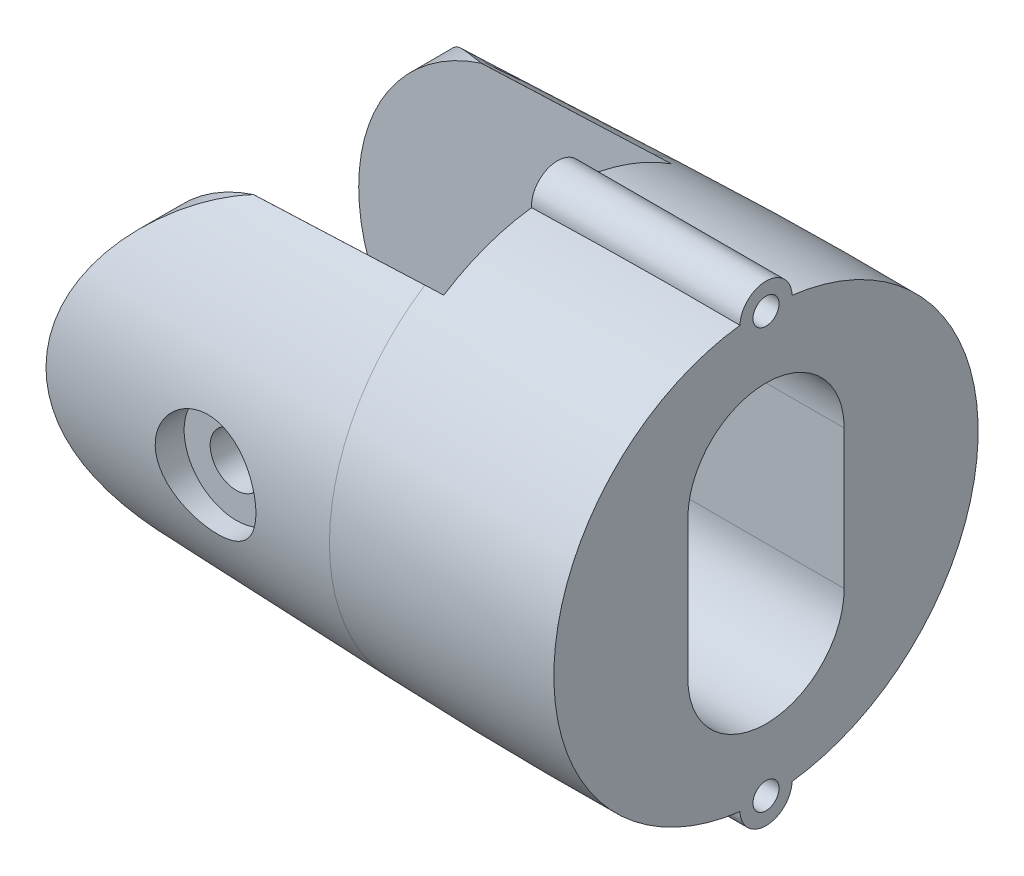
ISO-10303-21;
HEADER;
FILE_DESCRIPTION(('STEP AP214'),'2;1');
FILE_NAME('part.step','',(''),(''),'','','');
FILE_SCHEMA(('AUTOMOTIVE_DESIGN { 1 0 10303 214 1 1 1 1 }'));
ENDSEC;
DATA;
#1=APPLICATION_CONTEXT('core data for automotive mechanical design processes');
#2=APPLICATION_PROTOCOL_DEFINITION('international standard','automotive_design',2000,#1);
#3=PRODUCT_CONTEXT('',#1,'mechanical');
#4=PRODUCT('Part','Part','',(#3));
#5=PRODUCT_RELATED_PRODUCT_CATEGORY('part','',(#4));
#6=PRODUCT_DEFINITION_FORMATION('','',#4);
#7=PRODUCT_DEFINITION_CONTEXT('part definition',#1,'design');
#8=PRODUCT_DEFINITION('design','',#6,#7);
#9=PRODUCT_DEFINITION_SHAPE('','',#8);
#10=(LENGTH_UNIT() NAMED_UNIT(*) SI_UNIT(.MILLI.,.METRE.));
#11=(NAMED_UNIT(*) PLANE_ANGLE_UNIT() SI_UNIT($,.RADIAN.));
#12=(NAMED_UNIT(*) SI_UNIT($,.STERADIAN.) SOLID_ANGLE_UNIT());
#13=UNCERTAINTY_MEASURE_WITH_UNIT(LENGTH_MEASURE(1.E-05),#10,'distance_accuracy_value','');
#14=(GEOMETRIC_REPRESENTATION_CONTEXT(3) GLOBAL_UNCERTAINTY_ASSIGNED_CONTEXT((#13)) GLOBAL_UNIT_ASSIGNED_CONTEXT((#10,
#11,#12)) REPRESENTATION_CONTEXT('',''));
#15=CARTESIAN_POINT('',(0.,0.,0.));
#16=DIRECTION('',(0.,0.,1.));
#17=DIRECTION('',(1.,0.,0.));
#18=AXIS2_PLACEMENT_3D('',#15,#16,#17);
#19=CARTESIAN_POINT('',(-2.62045474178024,0.,0.));
#20=DIRECTION('',(-1.,0.,0.));
#21=DIRECTION('',(0.,0.,1.));
#22=AXIS2_PLACEMENT_3D('',#19,#20,#21);
#23=DEGENERATE_TOROIDAL_SURFACE('',#22,287.774371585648,300.,.F.);
#24=CARTESIAN_POINT('',(0.000200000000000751,-12.1218015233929,1.49938825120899));
#25=CARTESIAN_POINT('',(-0.499801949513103,-12.1262191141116,1.49925589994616));
#26=CARTESIAN_POINT('',(-0.999814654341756,-12.1293735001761,1.49915250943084));
#27=CARTESIAN_POINT('',(-1.99982426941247,-12.1331533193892,1.49902359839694));
#28=CARTESIAN_POINT('',(-2.49982117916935,-12.1337788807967,1.49899807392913));
#29=CARTESIAN_POINT('',(-3.74991740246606,-12.1321788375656,1.49905651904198));
#30=CARTESIAN_POINT('',(-4.50001522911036,-12.1283705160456,1.49920164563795));
#31=CARTESIAN_POINT('',(-6.00016372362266,-12.1150736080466,1.49957939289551));
#32=CARTESIAN_POINT('',(-6.75021439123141,-12.1055849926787,1.49981201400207));
#33=CARTESIAN_POINT('',(-8.25033763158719,-12.0809641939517,1.50005149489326));
#34=CARTESIAN_POINT('',(-9.00041019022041,-12.0658311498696,1.50005832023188));
#35=CARTESIAN_POINT('',(-10.5004176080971,-12.0299905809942,1.49929865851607));
#36=CARTESIAN_POINT('',(-11.250352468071,-12.0092830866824,1.49853217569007));
#37=CARTESIAN_POINT('',(-12.0002,-11.9858227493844,1.49710531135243));
#38=B_SPLINE_CURVE_WITH_KNOTS('',3,(#24,#25,#26,#27,#28,#29,#30,#31,#32,#33,#34,#35,#36,#37),
.UNSPECIFIED.,.F.,.F.,(4,2,2,2,2,2,4),(0.,1.50006201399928,3.00004794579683,5.2503476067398,
7.50065871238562,9.75131310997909,12.0019552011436),.UNSPECIFIED.);
#39=CARTESIAN_POINT('',(0.,-12.1218032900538,1.49938820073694));
#40=VERTEX_POINT('',#39);
#41=CARTESIAN_POINT('',(-12.,-11.9858290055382,1.49710570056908));
#42=VERTEX_POINT('',#41);
#43=EDGE_CURVE('E212',#40,#42,#38,.T.);
#44=ORIENTED_EDGE('',*,*,#43,.F.);
#45=CARTESIAN_POINT('',(0.,0.,0.));
#46=DIRECTION('',(1.,0.,0.));
#47=DIRECTION('',(0.,0.,-1.));
#48=AXIS2_PLACEMENT_3D('',#45,#46,#47);
#49=CIRCLE('',#48,12.2141835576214);
#50=CARTESIAN_POINT('',(0.,12.1218032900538,1.49938820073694));
#51=VERTEX_POINT('',#50);
#52=EDGE_CURVE('E203',#40,#51,#49,.F.);
#53=ORIENTED_EDGE('',*,*,#52,.T.);
#54=CARTESIAN_POINT('',(-12.0002,11.9858227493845,1.49710531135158));
#55=CARTESIAN_POINT('',(-11.5004401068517,12.0014562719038,1.49807423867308));
#56=CARTESIAN_POINT('',(-11.000642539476,12.0158695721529,1.49873001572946));
#57=CARTESIAN_POINT('',(-10.000974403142,12.0422315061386,1.49960848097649));
#58=CARTESIAN_POINT('',(-9.50110383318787,12.0541801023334,1.49983116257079));
#59=CARTESIAN_POINT('',(-7.83333664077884,12.0898906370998,1.50017390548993));
#60=CARTESIAN_POINT('',(-6.66531646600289,12.1081039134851,1.49975925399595));
#61=CARTESIAN_POINT('',(-4.32914528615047,12.1307534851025,1.49914906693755));
#62=CARTESIAN_POINT('',(-3.16099428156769,12.1351898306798,1.49895353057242));
#63=CARTESIAN_POINT('',(-1.66068097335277,12.1320141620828,1.49906025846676));
#64=CARTESIAN_POINT('',(-1.32849831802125,12.1307523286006,1.4991064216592));
#65=CARTESIAN_POINT('',(-0.664142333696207,12.1271131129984,1.49922867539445));
#66=CARTESIAN_POINT('',(-0.331969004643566,12.1247357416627,1.49930476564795));
#67=CARTESIAN_POINT('',(0.000199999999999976,12.1218015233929,1.49938825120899));
#68=B_SPLINE_CURVE_WITH_KNOTS('',3,(#54,#55,#56,#57,#58,#59,#60,#61,#62,#63,#64,#65,#66,#67),
.UNSPECIFIED.,.F.,.F.,(4,2,2,2,2,2,4),(0.,1.50001214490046,3.00004713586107,6.50444848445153,
10.0088370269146,11.0053909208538,12.0019351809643),.UNSPECIFIED.);
#69=CARTESIAN_POINT('',(-12.,11.9858290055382,1.49710570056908));
#70=VERTEX_POINT('',#69);
#71=EDGE_CURVE('E248',#70,#51,#68,.T.);
#72=ORIENTED_EDGE('',*,*,#71,.F.);
#73=CARTESIAN_POINT('',(-12.,0.,0.));
#74=DIRECTION('',(-1.,0.,0.));
#75=DIRECTION('',(0.,0.,1.));
#76=AXIS2_PLACEMENT_3D('',#73,#74,#75);
#77=CIRCLE('',#76,12.0789661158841);
#78=CARTESIAN_POINT('',(-12.,10.1488384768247,6.55));
#79=VERTEX_POINT('',#78);
#80=EDGE_CURVE('E479',#79,#70,#77,.T.);
#81=ORIENTED_EDGE('',*,*,#80,.F.);
#82=CARTESIAN_POINT('',(-12.6876363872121,10.1222885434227,6.55));
#83=CARTESIAN_POINT('',(-12.5730364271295,10.1268716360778,6.55));
#84=CARTESIAN_POINT('',(-12.4584334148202,10.1313756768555,6.55));
#85=CARTESIAN_POINT('',(-12.2292212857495,10.1402256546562,6.55));
#86=CARTESIAN_POINT('',(-12.1146121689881,10.1445715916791,6.55));
#87=CARTESIAN_POINT('',(-12.,10.1488384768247,6.55));
#88=B_SPLINE_CURVE_WITH_KNOTS('',3,(#82,#83,#84,#85,#86,#87),.UNSPECIFIED.,.F.,.F.,(4,2,4),(0.,
0.344074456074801,0.688148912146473),.UNSPECIFIED.);
#89=CARTESIAN_POINT('',(-12.6876363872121,10.1222885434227,6.55));
#90=VERTEX_POINT('',#89);
#91=EDGE_CURVE('E493',#90,#79,#88,.T.);
#92=ORIENTED_EDGE('',*,*,#91,.F.);
#93=CARTESIAN_POINT('',(-13.0903037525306,10.1053582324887,6.55077170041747));
#94=CARTESIAN_POINT('',(-13.023192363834,10.1081799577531,6.55072731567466));
#95=CARTESIAN_POINT('',(-12.956081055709,10.1110016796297,6.55064081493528));
#96=CARTESIAN_POINT('',(-12.8218586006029,10.1166451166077,6.55038358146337));
#97=CARTESIAN_POINT('',(-12.7547474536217,10.1194668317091,6.55021284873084));
#98=CARTESIAN_POINT('',(-12.6876363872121,10.1222885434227,6.55000000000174));
#99=B_SPLINE_CURVE_WITH_KNOTS('',3,(#93,#94,#95,#96,#97,#98),.UNSPECIFIED.,.F.,.F.,(4,2,4),(0.,
0.201511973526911,0.403023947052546),.UNSPECIFIED.);
#100=CARTESIAN_POINT('',(-13.0903037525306,10.1053582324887,6.5507717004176));
#101=VERTEX_POINT('',#100);
#102=EDGE_CURVE('E387',#101,#90,#99,.T.);
#103=ORIENTED_EDGE('',*,*,#102,.F.);
#104=CARTESIAN_POINT('',(-13.0903037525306,0.,0.));
#105=DIRECTION('',(1.,0.,0.));
#106=DIRECTION('',(0.,0.,-1.));
#107=AXIS2_PLACEMENT_3D('',#104,#105,#106);
#108=CIRCLE('',#107,12.0428765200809);
#109=CARTESIAN_POINT('',(-13.0903037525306,-10.1053582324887,6.55077170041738));
#110=VERTEX_POINT('',#109);
#111=EDGE_CURVE('E523',#110,#101,#108,.F.);
#112=ORIENTED_EDGE('',*,*,#111,.F.);
#113=CARTESIAN_POINT('',(-12.6876363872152,-10.1222885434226,6.55));
#114=CARTESIAN_POINT('',(-12.7547474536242,-10.119466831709,6.55021284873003));
#115=CARTESIAN_POINT('',(-12.8218586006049,-10.1166451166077,6.55038358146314));
#116=CARTESIAN_POINT('',(-12.95608105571,-10.1110016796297,6.55064081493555));
#117=CARTESIAN_POINT('',(-13.0231923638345,-10.1081799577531,6.55072731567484));
#118=CARTESIAN_POINT('',(-13.0903037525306,-10.1053582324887,6.55077170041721));
#119=B_SPLINE_CURVE_WITH_KNOTS('',3,(#113,#114,#115,#116,#117,#118),.UNSPECIFIED.,.F.,.F.,(4,2,
4),(0.,0.201511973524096,0.403023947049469),.UNSPECIFIED.);
#120=CARTESIAN_POINT('',(-12.6876363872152,-10.1222885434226,6.55));
#121=VERTEX_POINT('',#120);
#122=EDGE_CURVE('E381',#121,#110,#119,.T.);
#123=ORIENTED_EDGE('',*,*,#122,.F.);
#124=CARTESIAN_POINT('',(-12.,-10.1488384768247,6.55));
#125=CARTESIAN_POINT('',(-12.1146121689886,-10.1445715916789,6.55));
#126=CARTESIAN_POINT('',(-12.2292212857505,-10.140225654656,6.55));
#127=CARTESIAN_POINT('',(-12.4584334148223,-10.1313756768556,6.55));
#128=CARTESIAN_POINT('',(-12.5730364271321,-10.1268716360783,6.55));
#129=CARTESIAN_POINT('',(-12.6876363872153,-10.1222885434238,6.55));
#130=B_SPLINE_CURVE_WITH_KNOTS('',3,(#124,#125,#126,#127,#128,#129),.UNSPECIFIED.,.F.,.F.,(4,2,
4),(0.,0.344074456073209,0.688148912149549),.UNSPECIFIED.);
#131=CARTESIAN_POINT('',(-12.,-10.1488384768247,6.55));
#132=VERTEX_POINT('',#131);
#133=EDGE_CURVE('E388',#132,#121,#130,.T.);
#134=ORIENTED_EDGE('',*,*,#133,.F.);
#135=CARTESIAN_POINT('',(-12.,0.,0.));
#136=DIRECTION('',(-1.,0.,0.));
#137=DIRECTION('',(0.,0.,1.));
#138=AXIS2_PLACEMENT_3D('',#135,#136,#137);
#139=CIRCLE('',#138,12.0789661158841);
#140=EDGE_CURVE('E51',#42,#132,#139,.T.);
#141=ORIENTED_EDGE('',*,*,#140,.F.);
#142=EDGE_LOOP('',(#44,#53,#72,#81,#92,#103,#112,#123,#134,#141));
#143=FACE_BOUND('',#142,.T.);
#144=ADVANCED_FACE('F35',(#143),#23,.F.);
#145=CARTESIAN_POINT('',(-12.0002,-11.9858227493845,-1.49710531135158));
#146=CARTESIAN_POINT('',(-11.5004401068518,-12.0014562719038,-1.49807423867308));
#147=CARTESIAN_POINT('',(-11.000642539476,-12.015869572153,-1.49873001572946));
#148=CARTESIAN_POINT('',(-10.000974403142,-12.0422315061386,-1.49960848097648));
#149=CARTESIAN_POINT('',(-9.50110383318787,-12.0541801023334,-1.49983116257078));
#150=CARTESIAN_POINT('',(-7.83333664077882,-12.0898906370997,-1.50017390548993));
#151=CARTESIAN_POINT('',(-6.66531646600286,-12.108103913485,-1.49975925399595));
#152=CARTESIAN_POINT('',(-4.32914528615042,-12.1307534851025,-1.49914906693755));
#153=CARTESIAN_POINT('',(-3.16099428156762,-12.1351898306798,-1.49895353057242));
#154=CARTESIAN_POINT('',(-1.6606809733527,-12.1320141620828,-1.49906025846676));
#155=CARTESIAN_POINT('',(-1.3284983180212,-12.1307523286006,-1.4991064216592));
#156=CARTESIAN_POINT('',(-0.66414233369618,-12.1271131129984,-1.49922867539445));
#157=CARTESIAN_POINT('',(-0.331969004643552,-12.1247357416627,-1.49930476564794));
#158=CARTESIAN_POINT('',(0.000200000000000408,-12.1218015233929,-1.49938825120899));
#159=B_SPLINE_CURVE_WITH_KNOTS('',3,(#145,#146,#147,#148,#149,#150,#151,#152,#153,#154,#155,
#156,#157,#158),.UNSPECIFIED.,.F.,.F.,(4,2,2,2,2,2,4),(0.,1.50001214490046,3.00004713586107,
6.50444848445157,10.0088370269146,11.0053909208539,12.0019351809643),.UNSPECIFIED.);
#160=CARTESIAN_POINT('',(-12.,-11.9858290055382,-1.49710570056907));
#161=VERTEX_POINT('',#160);
#162=CARTESIAN_POINT('',(0.,-12.1218032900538,-1.49938820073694));
#163=VERTEX_POINT('',#162);
#164=EDGE_CURVE('E59',#161,#163,#159,.T.);
#165=ORIENTED_EDGE('',*,*,#164,.F.);
#166=CARTESIAN_POINT('',(-12.,-10.1488384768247,-6.55));
#167=VERTEX_POINT('',#166);
#168=EDGE_CURVE('E486',#167,#161,#139,.T.);
#169=ORIENTED_EDGE('',*,*,#168,.F.);
#170=CARTESIAN_POINT('',(-12.6876363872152,-10.1222885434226,-6.55));
#171=CARTESIAN_POINT('',(-12.5730364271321,-10.1268716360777,-6.55));
#172=CARTESIAN_POINT('',(-12.4584334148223,-10.1313756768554,-6.55));
#173=CARTESIAN_POINT('',(-12.2292212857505,-10.1402256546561,-6.55));
#174=CARTESIAN_POINT('',(-12.1146121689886,-10.1445715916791,-6.55));
#175=CARTESIAN_POINT('',(-12.,-10.1488384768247,-6.55));
#176=B_SPLINE_CURVE_WITH_KNOTS('',3,(#170,#171,#172,#173,#174,#175),.UNSPECIFIED.,.F.,.F.,(4,2,
4),(0.,0.344074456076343,0.688148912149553),.UNSPECIFIED.);
#177=CARTESIAN_POINT('',(-12.6876363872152,-10.1222885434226,-6.55));
#178=VERTEX_POINT('',#177);
#179=EDGE_CURVE('E488',#178,#167,#176,.T.);
#180=ORIENTED_EDGE('',*,*,#179,.F.);
#181=CARTESIAN_POINT('',(-13.0903037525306,-10.1053582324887,-6.55077170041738));
#182=CARTESIAN_POINT('',(-13.0231923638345,-10.1081799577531,-6.55072731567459));
#183=CARTESIAN_POINT('',(-12.95608105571,-10.1110016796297,-6.55064081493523));
#184=CARTESIAN_POINT('',(-12.8218586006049,-10.1166451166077,-6.55038358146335));
#185=CARTESIAN_POINT('',(-12.7547474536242,-10.119466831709,-6.55021284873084));
#186=CARTESIAN_POINT('',(-12.6876363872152,-10.1222885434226,-6.55000000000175));
#187=B_SPLINE_CURVE_WITH_KNOTS('',3,(#181,#182,#183,#184,#185,#186),.UNSPECIFIED.,.F.,.F.,(4,2,
4),(0.,0.201511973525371,0.403023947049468),.UNSPECIFIED.);
#188=CARTESIAN_POINT('',(-13.0903037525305,-10.1053582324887,-6.55077170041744));
#189=VERTEX_POINT('',#188);
#190=EDGE_CURVE('E374',#189,#178,#187,.T.);
#191=ORIENTED_EDGE('',*,*,#190,.F.);
#192=CARTESIAN_POINT('',(-13.0903037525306,0.,0.));
#193=DIRECTION('',(1.,0.,0.));
#194=DIRECTION('',(0.,0.,-1.));
#195=AXIS2_PLACEMENT_3D('',#192,#193,#194);
#196=CIRCLE('',#195,12.0428765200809);
#197=CARTESIAN_POINT('',(-13.0903037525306,10.1053582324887,-6.5507717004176));
#198=VERTEX_POINT('',#197);
#199=EDGE_CURVE('E519',#198,#189,#196,.F.);
#200=ORIENTED_EDGE('',*,*,#199,.F.);
#201=CARTESIAN_POINT('',(-12.6876363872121,10.1222885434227,-6.55));
#202=CARTESIAN_POINT('',(-12.7547474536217,10.1194668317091,-6.55021284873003));
#203=CARTESIAN_POINT('',(-12.8218586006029,10.1166451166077,-6.55038358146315));
#204=CARTESIAN_POINT('',(-12.956081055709,10.1110016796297,-6.55064081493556));
#205=CARTESIAN_POINT('',(-13.023192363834,10.1081799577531,-6.55072731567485));
#206=CARTESIAN_POINT('',(-13.0903037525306,10.1053582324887,-6.55077170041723));
#207=B_SPLINE_CURVE_WITH_KNOTS('',3,(#201,#202,#203,#204,#205,#206),.UNSPECIFIED.,.F.,.F.,(4,2,
4),(0.,0.201511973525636,0.403023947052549),.UNSPECIFIED.);
#208=CARTESIAN_POINT('',(-12.6876363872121,10.1222885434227,-6.55));
#209=VERTEX_POINT('',#208);
#210=EDGE_CURVE('E397',#209,#198,#207,.T.);
#211=ORIENTED_EDGE('',*,*,#210,.F.);
#212=CARTESIAN_POINT('',(-12.,10.1488384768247,-6.55));
#213=CARTESIAN_POINT('',(-12.114612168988,10.1445715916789,-6.55));
#214=CARTESIAN_POINT('',(-12.2292212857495,10.140225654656,-6.55));
#215=CARTESIAN_POINT('',(-12.4584334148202,10.1313756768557,-6.55));
#216=CARTESIAN_POINT('',(-12.5730364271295,10.1268716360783,-6.55));
#217=CARTESIAN_POINT('',(-12.6876363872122,10.1222885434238,-6.55));
#218=B_SPLINE_CURVE_WITH_KNOTS('',3,(#212,#213,#214,#215,#216,#217),.UNSPECIFIED.,.F.,.F.,(4,2,
4),(0.,0.344074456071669,0.688148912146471),.UNSPECIFIED.);
#219=CARTESIAN_POINT('',(-12.,10.1488384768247,-6.55));
#220=VERTEX_POINT('',#219);
#221=EDGE_CURVE('E511',#220,#209,#218,.T.);
#222=ORIENTED_EDGE('',*,*,#221,.F.);
#223=CARTESIAN_POINT('',(-12.,11.9858290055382,-1.49710570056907));
#224=VERTEX_POINT('',#223);
#225=EDGE_CURVE('E484',#224,#220,#77,.T.);
#226=ORIENTED_EDGE('',*,*,#225,.F.);
#227=CARTESIAN_POINT('',(0.000200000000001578,12.1218015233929,-1.49938825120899));
#228=CARTESIAN_POINT('',(-0.499801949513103,12.1262191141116,-1.49925589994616));
#229=CARTESIAN_POINT('',(-0.999814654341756,12.129373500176,-1.49915250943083));
#230=CARTESIAN_POINT('',(-1.99982426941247,12.1331533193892,-1.49902359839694));
#231=CARTESIAN_POINT('',(-2.49982117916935,12.1337788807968,-1.49899807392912));
#232=CARTESIAN_POINT('',(-3.74991740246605,12.1321788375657,-1.49905651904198));
#233=CARTESIAN_POINT('',(-4.50001522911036,12.1283705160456,-1.49920164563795));
#234=CARTESIAN_POINT('',(-6.00016372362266,12.1150736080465,-1.49957939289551));
#235=CARTESIAN_POINT('',(-6.7502143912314,12.1055849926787,-1.49981201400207));
#236=CARTESIAN_POINT('',(-8.25033763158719,12.0809641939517,-1.50005149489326));
#237=CARTESIAN_POINT('',(-9.00041019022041,12.0658311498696,-1.50005832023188));
#238=CARTESIAN_POINT('',(-10.5004176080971,12.0299905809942,-1.49929865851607));
#239=CARTESIAN_POINT('',(-11.250352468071,12.0092830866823,-1.49853217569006));
#240=CARTESIAN_POINT('',(-12.0002,11.9858227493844,-1.49710531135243));
#241=B_SPLINE_CURVE_WITH_KNOTS('',3,(#227,#228,#229,#230,#231,#232,#233,#234,#235,#236,#237,
#238,#239,#240),.UNSPECIFIED.,.F.,.F.,(4,2,2,2,2,2,4),(0.,1.50006201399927,3.00004794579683,
5.2503476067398,7.50065871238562,9.7513131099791,12.0019552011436),.UNSPECIFIED.);
#242=CARTESIAN_POINT('',(0.,12.1218032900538,-1.49938820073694));
#243=VERTEX_POINT('',#242);
#244=EDGE_CURVE('E197',#243,#224,#241,.T.);
#245=ORIENTED_EDGE('',*,*,#244,.F.);
#246=EDGE_CURVE('E195',#243,#163,#49,.F.);
#247=ORIENTED_EDGE('',*,*,#246,.T.);
#248=EDGE_LOOP('',(#165,#169,#180,#191,#200,#211,#222,#226,#245,#247));
#249=FACE_BOUND('',#248,.T.);
#250=ADVANCED_FACE('F37',(#249),#23,.F.);
#251=CARTESIAN_POINT('',(8.,4.,0.));
#252=DIRECTION('',(-1.,0.,0.));
#253=DIRECTION('',(0.,0.,1.));
#254=AXIS2_PLACEMENT_3D('',#251,#252,#253);
#255=CYLINDRICAL_SURFACE('',#254,4.5);
#256=CARTESIAN_POINT('',(0.,4.,0.));
#257=DIRECTION('',(1.,0.,0.));
#258=DIRECTION('',(0.,0.,-1.));
#259=AXIS2_PLACEMENT_3D('',#256,#257,#258);
#260=CIRCLE('',#259,4.5);
#261=CARTESIAN_POINT('',(0.,4.,4.5));
#262=VERTEX_POINT('',#261);
#263=CARTESIAN_POINT('',(0.,4.,-4.5));
#264=VERTEX_POINT('',#263);
#265=EDGE_CURVE('E262',#262,#264,#260,.F.);
#266=ORIENTED_EDGE('',*,*,#265,.F.);
#267=DIRECTION('',(-1.,0.,0.));
#268=VECTOR('',#267,1.);
#269=CARTESIAN_POINT('',(8.,4.,4.5));
#270=LINE('',#269,#268);
#271=CARTESIAN_POINT('',(-12.,4.,4.5));
#272=VERTEX_POINT('',#271);
#273=EDGE_CURVE('E276',#262,#272,#270,.T.);
#274=ORIENTED_EDGE('',*,*,#273,.T.);
#275=CARTESIAN_POINT('',(-12.,4.,0.));
#276=DIRECTION('',(-1.,0.,0.));
#277=DIRECTION('',(0.,0.,1.));
#278=AXIS2_PLACEMENT_3D('',#275,#276,#277);
#279=CIRCLE('',#278,4.5);
#280=CARTESIAN_POINT('',(-12.,4.,-4.5));
#281=VERTEX_POINT('',#280);
#282=EDGE_CURVE('E202',#272,#281,#279,.T.);
#283=ORIENTED_EDGE('',*,*,#282,.T.);
#284=DIRECTION('',(-1.,0.,0.));
#285=VECTOR('',#284,1.);
#286=CARTESIAN_POINT('',(8.,4.,-4.5));
#287=LINE('',#286,#285);
#288=EDGE_CURVE('E275',#264,#281,#287,.T.);
#289=ORIENTED_EDGE('',*,*,#288,.F.);
#290=EDGE_LOOP('',(#266,#274,#283,#289));
#291=FACE_BOUND('',#290,.T.);
#292=ADVANCED_FACE('F469',(#291),#255,.F.);
#293=CARTESIAN_POINT('',(8.,4.,4.5));
#294=DIRECTION('',(0.,0.,1.));
#295=DIRECTION('',(1.,0.,0.));
#296=AXIS2_PLACEMENT_3D('',#293,#294,#295);
#297=PLANE('',#296);
#298=DIRECTION('',(0.,1.,0.));
#299=VECTOR('',#298,1.);
#300=CARTESIAN_POINT('',(0.,4.,4.5));
#301=LINE('',#300,#299);
#302=CARTESIAN_POINT('',(0.,-4.,4.5));
#303=VERTEX_POINT('',#302);
#304=EDGE_CURVE('E260',#303,#262,#301,.T.);
#305=ORIENTED_EDGE('',*,*,#304,.F.);
#306=DIRECTION('',(-1.,0.,0.));
#307=VECTOR('',#306,1.);
#308=CARTESIAN_POINT('',(8.,-4.,4.5));
#309=LINE('',#308,#307);
#310=CARTESIAN_POINT('',(-12.,-4.,4.5));
#311=VERTEX_POINT('',#310);
#312=EDGE_CURVE('E279',#303,#311,#309,.T.);
#313=ORIENTED_EDGE('',*,*,#312,.T.);
#314=DIRECTION('',(0.,1.,0.));
#315=VECTOR('',#314,1.);
#316=CARTESIAN_POINT('',(-12.,4.,4.5));
#317=LINE('',#316,#315);
#318=EDGE_CURVE('E272',#311,#272,#317,.T.);
#319=ORIENTED_EDGE('',*,*,#318,.T.);
#320=ORIENTED_EDGE('',*,*,#273,.F.);
#321=EDGE_LOOP('',(#305,#313,#319,#320));
#322=FACE_BOUND('',#321,.T.);
#323=ADVANCED_FACE('F635',(#322),#297,.F.);
#324=CARTESIAN_POINT('',(8.,-4.,0.));
#325=DIRECTION('',(-1.,0.,0.));
#326=DIRECTION('',(0.,0.,1.));
#327=AXIS2_PLACEMENT_3D('',#324,#325,#326);
#328=CYLINDRICAL_SURFACE('',#327,4.5);
#329=CARTESIAN_POINT('',(0.,-4.,0.));
#330=DIRECTION('',(1.,0.,0.));
#331=DIRECTION('',(0.,0.,-1.));
#332=AXIS2_PLACEMENT_3D('',#329,#330,#331);
#333=CIRCLE('',#332,4.5);
#334=CARTESIAN_POINT('',(0.,-4.,-4.5));
#335=VERTEX_POINT('',#334);
#336=EDGE_CURVE('E258',#335,#303,#333,.F.);
#337=ORIENTED_EDGE('',*,*,#336,.F.);
#338=DIRECTION('',(-1.,0.,0.));
#339=VECTOR('',#338,1.);
#340=CARTESIAN_POINT('',(8.,-4.,-4.5));
#341=LINE('',#340,#339);
#342=CARTESIAN_POINT('',(-12.,-4.,-4.5));
#343=VERTEX_POINT('',#342);
#344=EDGE_CURVE('E281',#335,#343,#341,.T.);
#345=ORIENTED_EDGE('',*,*,#344,.T.);
#346=CARTESIAN_POINT('',(-12.,-4.,0.));
#347=DIRECTION('',(-1.,0.,0.));
#348=DIRECTION('',(0.,0.,1.));
#349=AXIS2_PLACEMENT_3D('',#346,#347,#348);
#350=CIRCLE('',#349,4.5);
#351=EDGE_CURVE('E269',#343,#311,#350,.T.);
#352=ORIENTED_EDGE('',*,*,#351,.T.);
#353=ORIENTED_EDGE('',*,*,#312,.F.);
#354=EDGE_LOOP('',(#337,#345,#352,#353));
#355=FACE_BOUND('',#354,.T.);
#356=ADVANCED_FACE('F627',(#355),#328,.F.);
#357=CARTESIAN_POINT('',(8.,4.,-4.5));
#358=DIRECTION('',(0.,0.,-1.));
#359=DIRECTION('',(0.,1.,0.));
#360=AXIS2_PLACEMENT_3D('',#357,#358,#359);
#361=PLANE('',#360);
#362=DIRECTION('',(0.,-1.,0.));
#363=VECTOR('',#362,1.);
#364=CARTESIAN_POINT('',(0.,4.,-4.5));
#365=LINE('',#364,#363);
#366=EDGE_CURVE('E11',#264,#335,#365,.T.);
#367=ORIENTED_EDGE('',*,*,#366,.F.);
#368=ORIENTED_EDGE('',*,*,#288,.T.);
#369=DIRECTION('',(0.,-1.,0.));
#370=VECTOR('',#369,1.);
#371=CARTESIAN_POINT('',(-12.,4.,-4.5));
#372=LINE('',#371,#370);
#373=EDGE_CURVE('E266',#281,#343,#372,.T.);
#374=ORIENTED_EDGE('',*,*,#373,.T.);
#375=ORIENTED_EDGE('',*,*,#344,.F.);
#376=EDGE_LOOP('',(#367,#368,#374,#375));
#377=FACE_BOUND('',#376,.T.);
#378=ADVANCED_FACE('F620',(#377),#361,.F.);
#379=CARTESIAN_POINT('',(0.,0.,0.));
#380=DIRECTION('',(1.,0.,0.));
#381=DIRECTION('',(0.,0.,-1.));
#382=AXIS2_PLACEMENT_3D('',#379,#380,#381);
#383=CONICAL_SURFACE('',#382,12.5,0.0349065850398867);
#384=CARTESIAN_POINT('',(-20.9999999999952,-9.77279188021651,0.));
#385=DIRECTION('',(0.0420082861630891,0.999117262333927,0.));
#386=DIRECTION('',(0.999117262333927,-0.0420082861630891,0.));
#387=AXIS2_PLACEMENT_3D('',#384,#385,#386);
#388=ELLIPSE('',#387,280.103401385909,6.55338971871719);
#389=CARTESIAN_POINT('',(-22.9498771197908,-9.69080851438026,6.55323064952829));
#390=VERTEX_POINT('',#389);
#391=EDGE_CURVE('E330',#110,#390,#388,.F.);
#392=ORIENTED_EDGE('',*,*,#391,.F.);
#393=ORIENTED_EDGE('',*,*,#111,.T.);
#394=CARTESIAN_POINT('',(-21.0000000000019,9.77279188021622,0.));
#395=DIRECTION('',(0.0420082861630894,-0.999117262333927,0.));
#396=DIRECTION('',(0.999117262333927,0.0420082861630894,0.));
#397=AXIS2_PLACEMENT_3D('',#394,#395,#396);
#398=ELLIPSE('',#397,280.103401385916,6.55338971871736);
#399=CARTESIAN_POINT('',(-22.9498771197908,9.69080851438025,6.55323064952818));
#400=VERTEX_POINT('',#399);
#401=EDGE_CURVE('E345',#400,#101,#398,.F.);
#402=ORIENTED_EDGE('',*,*,#401,.F.);
#403=CARTESIAN_POINT('',(-22.9496771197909,-9.69087321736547,6.55314743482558));
#404=CARTESIAN_POINT('',(-23.0999575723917,-9.64224563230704,6.61570730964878));
#405=CARTESIAN_POINT('',(-23.2478404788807,-9.59055452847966,6.68148349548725));
#406=CARTESIAN_POINT('',(-23.5388927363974,-9.48133076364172,6.81818877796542));
#407=CARTESIAN_POINT('',(-23.6820646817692,-9.42380139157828,6.88911496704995));
#408=CARTESIAN_POINT('',(-23.9637096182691,-9.30323209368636,7.03479189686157));
#409=CARTESIAN_POINT('',(-24.1021900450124,-9.24020151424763,7.10953606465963));
#410=CARTESIAN_POINT('',(-24.3748915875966,-9.10870549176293,7.26198183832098));
#411=CARTESIAN_POINT('',(-24.5091120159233,-9.04023917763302,7.33968391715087));
#412=CARTESIAN_POINT('',(-24.9067360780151,-8.82626761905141,7.576586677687));
#413=CARTESIAN_POINT('',(-25.1639513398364,-8.67268558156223,7.73897252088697));
#414=CARTESIAN_POINT('',(-25.6627140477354,-8.34449966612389,8.06673484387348));
#415=CARTESIAN_POINT('',(-25.9042534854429,-8.16988517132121,8.23211279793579));
#416=CARTESIAN_POINT('',(-26.3703049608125,-7.80080677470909,8.56062203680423));
#417=CARTESIAN_POINT('',(-26.5949089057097,-7.60646583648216,8.72376081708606));
#418=CARTESIAN_POINT('',(-27.0280580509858,-7.19700739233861,9.04519751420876));
#419=CARTESIAN_POINT('',(-27.2366050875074,-6.98189226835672,9.2034959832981));
#420=CARTESIAN_POINT('',(-27.6360975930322,-6.53121939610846,9.51167898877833));
#421=CARTESIAN_POINT('',(-27.8270761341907,-6.29570174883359,9.66157911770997));
#422=CARTESIAN_POINT('',(-28.1900952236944,-5.80401574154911,9.95003154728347));
#423=CARTESIAN_POINT('',(-28.3621410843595,-5.54785320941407,10.0885870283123));
#424=CARTESIAN_POINT('',(-28.6444267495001,-5.08239404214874,10.3180459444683));
#425=CARTESIAN_POINT('',(-28.7593317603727,-4.87750264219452,10.4121728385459));
#426=CARTESIAN_POINT('',(-28.9761412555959,-4.45694744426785,10.5907939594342));
#427=CARTESIAN_POINT('',(-29.0780488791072,-4.2412862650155,10.675290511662));
#428=CARTESIAN_POINT('',(-29.2676474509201,-3.79997961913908,10.8332083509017));
#429=CARTESIAN_POINT('',(-29.3553442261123,-3.57433829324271,10.906634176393));
#430=CARTESIAN_POINT('',(-29.5153456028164,-3.11403643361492,11.0410652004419));
#431=CARTESIAN_POINT('',(-29.5876498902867,-2.87937571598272,11.1020701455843));
#432=CARTESIAN_POINT('',(-29.7162027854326,-2.40053071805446,11.2108086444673));
#433=CARTESIAN_POINT('',(-29.772316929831,-2.15628480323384,11.258430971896));
#434=CARTESIAN_POINT('',(-29.8666511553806,-1.66190955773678,11.3386228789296));
#435=CARTESIAN_POINT('',(-29.9048712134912,-1.41178021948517,11.3711924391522));
#436=CARTESIAN_POINT('',(-29.9626180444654,-0.90794314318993,11.4204426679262));
#437=CARTESIAN_POINT('',(-29.9821543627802,-0.654237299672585,11.4371314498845));
#438=CARTESIAN_POINT('',(-30.0021394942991,-0.145540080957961,11.4542038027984));
#439=CARTESIAN_POINT('',(-30.0025904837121,0.109451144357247,11.4545892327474));
#440=CARTESIAN_POINT('',(-29.9855286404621,0.586879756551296,11.4400138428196));
#441=CARTESIAN_POINT('',(-29.9702211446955,0.809459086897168,11.4269370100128));
#442=CARTESIAN_POINT('',(-29.9251968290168,1.25206526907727,11.3885221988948));
#443=CARTESIAN_POINT('',(-29.8954814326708,1.47209237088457,11.3631854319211));
#444=CARTESIAN_POINT('',(-29.8221169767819,1.90809854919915,11.3007487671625));
#445=CARTESIAN_POINT('',(-29.7784680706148,2.12407767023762,11.2636489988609));
#446=CARTESIAN_POINT('',(-29.6778851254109,2.55068328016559,11.1783739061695));
#447=CARTESIAN_POINT('',(-29.620950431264,2.76130950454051,11.1301980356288));
#448=CARTESIAN_POINT('',(-29.4939570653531,3.17809615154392,11.0230873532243));
#449=CARTESIAN_POINT('',(-29.4237771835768,3.38419396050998,10.9640533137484));
#450=CARTESIAN_POINT('',(-29.2714899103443,3.78897416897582,10.8364665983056));
#451=CARTESIAN_POINT('',(-29.1893779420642,3.98765368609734,10.7679102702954));
#452=CARTESIAN_POINT('',(-29.0141072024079,4.37686048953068,10.6222855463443));
#453=CARTESIAN_POINT('',(-28.9209473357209,4.56738696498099,10.5452163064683));
#454=CARTESIAN_POINT('',(-28.7244178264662,4.93981332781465,10.3835765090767));
#455=CARTESIAN_POINT('',(-28.6210460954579,5.1217114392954,10.2990044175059));
#456=CARTESIAN_POINT('',(-28.3547774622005,5.5587779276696,10.0826594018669));
#457=CARTESIAN_POINT('',(-28.1864907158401,5.80884921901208,9.94717125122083));
#458=CARTESIAN_POINT('',(-27.8318385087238,6.28929989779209,9.66535945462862));
#459=CARTESIAN_POINT('',(-27.6454670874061,6.51967274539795,9.51903224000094));
#460=CARTESIAN_POINT('',(-27.255849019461,6.96109265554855,9.2182246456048));
#461=CARTESIAN_POINT('',(-27.0525632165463,7.17209235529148,9.0637256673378));
#462=CARTESIAN_POINT('',(-26.6306079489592,7.57423731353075,8.74995503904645));
#463=CARTESIAN_POINT('',(-26.4119366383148,7.76538018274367,8.59068281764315));
#464=CARTESIAN_POINT('',(-25.9492205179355,8.13636680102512,8.26319972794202));
#465=CARTESIAN_POINT('',(-25.7044674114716,8.31526452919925,8.09491908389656));
#466=CARTESIAN_POINT('',(-25.1987488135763,8.65130250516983,7.76119702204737));
#467=CARTESIAN_POINT('',(-24.9377909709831,8.80845290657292,7.59575431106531));
#468=CARTESIAN_POINT('',(-24.5341882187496,9.02721478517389,7.35434233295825));
#469=CARTESIAN_POINT('',(-24.3979325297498,9.09717565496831,7.27516023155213));
#470=CARTESIAN_POINT('',(-24.1210230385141,9.23148090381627,7.11980775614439));
#471=CARTESIAN_POINT('',(-23.9803699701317,9.29582621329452,7.04363688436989));
#472=CARTESIAN_POINT('',(-23.6942321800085,9.41884065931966,6.89520186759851));
#473=CARTESIAN_POINT('',(-23.5487398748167,9.47750026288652,6.82294437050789));
#474=CARTESIAN_POINT('',(-23.2528861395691,9.58878931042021,6.68373021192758));
#475=CARTESIAN_POINT('',(-23.1025219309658,9.64141523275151,6.61677665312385));
#476=CARTESIAN_POINT('',(-22.9496771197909,9.69087321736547,6.55314743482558));
#477=B_SPLINE_CURVE_WITH_KNOTS('',3,(#403,#404,#405,#406,#407,#408,#409,#410,#411,#412,#413,
#414,#415,#416,#417,#418,#419,#420,#421,#422,#423,#424,#425,#426,#427,#428,#429,#430,#431,#432,
#433,#434,#435,#436,#437,#438,#439,#440,#441,#442,#443,#444,#445,#446,#447,#448,#449,#450,#451,
#452,#453,#454,#455,#456,#457,#458,#459,#460,#461,#462,#463,#464,#465,#466,#467,#468,#469,#470,
#471,#472,#473,#474,#475,#476),.UNSPECIFIED.,.F.,.F.,(4,2,2,2,2,2,2,2,2,2,2,2,2,2,2,2,2,2,2,2,2,
2,2,2,2,2,2,2,2,2,2,2,2,2,2,2,4),(0.,0.509508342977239,1.01873123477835,1.52710521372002,
2.03556082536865,3.0566421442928,4.07824106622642,5.0938231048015,6.1092888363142,
7.12280209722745,8.13603024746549,8.89456564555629,9.65291749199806,10.4109575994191,
11.1690131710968,11.9331943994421,12.6973766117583,13.4611681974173,14.2248726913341,
14.8945298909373,15.5641209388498,16.23370461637,16.9033213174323,17.5793923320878,
18.2557233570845,18.9321214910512,19.6086582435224,20.5986297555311,21.5889286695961,
22.5815875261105,23.5743656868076,24.6135573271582,25.6522621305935,26.169393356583,
26.6864387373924,27.204336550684,27.722535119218),.UNSPECIFIED.);
#478=EDGE_CURVE('E339',#390,#400,#477,.T.);
#479=ORIENTED_EDGE('',*,*,#478,.F.);
#480=EDGE_LOOP('',(#392,#393,#402,#479));
#481=FACE_BOUND('',#480,.T.);
#482=CARTESIAN_POINT('',(-22.5915563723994,-2.75628917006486,11.3821084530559));
#483=CARTESIAN_POINT('',(-22.7130119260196,-2.63816633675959,11.4063472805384));
#484=CARTESIAN_POINT('',(-22.8243953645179,-2.50978719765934,11.4315122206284));
#485=CARTESIAN_POINT('',(-23.0240436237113,-2.23593907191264,11.4811119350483));
#486=CARTESIAN_POINT('',(-23.112293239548,-2.09045893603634,11.5055462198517));
#487=CARTESIAN_POINT('',(-23.2631622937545,-1.78619715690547,11.5513590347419));
#488=CARTESIAN_POINT('',(-23.3257686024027,-1.62740874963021,11.572735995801));
#489=CARTESIAN_POINT('',(-23.4232574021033,-1.30100263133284,11.6105317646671));
#490=CARTESIAN_POINT('',(-23.458148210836,-1.13338758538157,11.6269520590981));
#491=CARTESIAN_POINT('',(-23.4986045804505,-0.796945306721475,11.653390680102));
#492=CARTESIAN_POINT('',(-23.5046393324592,-0.628182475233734,11.6635090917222));
#493=CARTESIAN_POINT('',(-23.4882864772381,-0.291777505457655,11.6773390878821));
#494=CARTESIAN_POINT('',(-23.4659012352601,-0.124135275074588,11.6810512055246));
#495=CARTESIAN_POINT('',(-23.3940567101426,0.201662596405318,11.6824345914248));
#496=CARTESIAN_POINT('',(-23.3451585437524,0.359941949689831,11.6802274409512));
#497=CARTESIAN_POINT('',(-23.2220828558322,0.666194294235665,11.6710735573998));
#498=CARTESIAN_POINT('',(-23.147904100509,0.81416678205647,11.6641265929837));
#499=CARTESIAN_POINT('',(-22.9757273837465,1.09684285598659,11.6470011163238));
#500=CARTESIAN_POINT('',(-22.8775555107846,1.23143898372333,11.6367988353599));
#501=CARTESIAN_POINT('',(-22.6603833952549,1.48251678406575,11.6151311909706));
#502=CARTESIAN_POINT('',(-22.5413808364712,1.59899643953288,11.603665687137));
#503=CARTESIAN_POINT('',(-22.2835790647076,1.81250622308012,11.581367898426));
#504=CARTESIAN_POINT('',(-22.1444825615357,1.90917924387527,11.5705493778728));
#505=CARTESIAN_POINT('',(-21.8518703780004,2.07784364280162,11.5518381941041));
#506=CARTESIAN_POINT('',(-21.6983553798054,2.14983618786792,11.5439453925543));
#507=CARTESIAN_POINT('',(-21.3819097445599,2.26676275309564,11.5328191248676));
#508=CARTESIAN_POINT('',(-21.219021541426,2.31180959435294,11.529566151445));
#509=CARTESIAN_POINT('',(-20.8879922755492,2.37394943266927,11.5287360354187));
#510=CARTESIAN_POINT('',(-20.7198518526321,2.3910458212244,11.5311582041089));
#511=CARTESIAN_POINT('',(-20.3860167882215,2.39678723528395,11.5418723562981));
#512=CARTESIAN_POINT('',(-20.220326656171,2.38588872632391,11.5500686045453));
#513=CARTESIAN_POINT('',(-19.8933384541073,2.33705091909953,11.5716977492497));
#514=CARTESIAN_POINT('',(-19.7320405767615,2.29911043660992,11.5851308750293));
#515=CARTESIAN_POINT('',(-19.4174998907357,2.19717746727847,11.6160725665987));
#516=CARTESIAN_POINT('',(-19.26429762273,2.13306574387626,11.6335996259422));
#517=CARTESIAN_POINT('',(-18.9707393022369,1.98064015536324,11.6709134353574));
#518=CARTESIAN_POINT('',(-18.8303851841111,1.89232265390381,11.6907005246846));
#519=CARTESIAN_POINT('',(-18.5632213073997,1.69164344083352,11.7308635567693));
#520=CARTESIAN_POINT('',(-18.4367751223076,1.57879789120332,11.7512429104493));
#521=CARTESIAN_POINT('',(-18.2044875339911,1.33324510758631,11.7897888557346));
#522=CARTESIAN_POINT('',(-18.0986467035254,1.20053732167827,11.8079553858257));
#523=CARTESIAN_POINT('',(-17.9104756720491,0.918565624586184,11.8398206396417));
#524=CARTESIAN_POINT('',(-17.8281831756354,0.769275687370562,11.8535122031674));
#525=CARTESIAN_POINT('',(-17.6899360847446,0.458544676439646,11.8744217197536));
#526=CARTESIAN_POINT('',(-17.633975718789,0.297106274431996,11.8816410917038));
#527=CARTESIAN_POINT('',(-17.551398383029,-0.0284247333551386,11.8881405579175));
#528=CARTESIAN_POINT('',(-17.524000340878,-0.192314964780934,11.8876382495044));
#529=CARTESIAN_POINT('',(-17.4966006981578,-0.522140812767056,11.8786789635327));
#530=CARTESIAN_POINT('',(-17.496595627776,-0.688076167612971,11.8702229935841));
#531=CARTESIAN_POINT('',(-17.5235146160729,-1.01400120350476,11.8458482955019));
#532=CARTESIAN_POINT('',(-17.549932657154,-1.17404401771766,11.8300727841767));
#533=CARTESIAN_POINT('',(-17.6278837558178,-1.48707850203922,11.7920706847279));
#534=CARTESIAN_POINT('',(-17.6794194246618,-1.64006943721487,11.7698434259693));
#535=CARTESIAN_POINT('',(-17.8072610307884,-1.93829717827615,11.7199387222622));
#536=CARTESIAN_POINT('',(-17.8840697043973,-2.08330035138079,11.6921555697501));
#537=CARTESIAN_POINT('',(-18.0598851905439,-2.35847608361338,11.6335083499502));
#538=CARTESIAN_POINT('',(-18.1588975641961,-2.4886449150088,11.602643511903));
#539=CARTESIAN_POINT('',(-18.3810297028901,-2.7360402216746,11.538893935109));
#540=CARTESIAN_POINT('',(-18.5049635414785,-2.85252883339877,11.5059780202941));
#541=CARTESIAN_POINT('',(-18.7710336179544,-3.06314963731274,11.4420908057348));
#542=CARTESIAN_POINT('',(-18.9131719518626,-3.15727925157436,11.4111197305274));
#543=CARTESIAN_POINT('',(-19.2134135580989,-3.32116326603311,11.3535887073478));
#544=CARTESIAN_POINT('',(-19.3716466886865,-3.39069515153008,11.3270701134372));
#545=CARTESIAN_POINT('',(-19.6986368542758,-3.5017524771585,11.2812787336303));
#546=CARTESIAN_POINT('',(-19.867390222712,-3.54328761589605,11.2620034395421));
#547=CARTESIAN_POINT('',(-20.2034215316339,-3.59556403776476,11.2330997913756));
#548=CARTESIAN_POINT('',(-20.3704868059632,-3.60747444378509,11.2231152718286));
#549=CARTESIAN_POINT('',(-20.7045656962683,-3.60328959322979,11.212206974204));
#550=CARTESIAN_POINT('',(-20.8715793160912,-3.58719783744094,11.2112820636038));
#551=CARTESIAN_POINT('',(-21.1944934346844,-3.52856974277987,11.2180463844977));
#552=CARTESIAN_POINT('',(-21.3505777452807,-3.48700030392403,11.2254285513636));
#553=CARTESIAN_POINT('',(-21.6535829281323,-3.37961466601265,11.2471747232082));
#554=CARTESIAN_POINT('',(-21.8005073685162,-3.31380797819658,11.261535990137));
#555=CARTESIAN_POINT('',(-22.0598896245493,-3.17177133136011,11.2928736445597));
#556=CARTESIAN_POINT('',(-22.1741779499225,-3.09868684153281,11.3091113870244));
#557=CARTESIAN_POINT('',(-22.391628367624,-2.93800258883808,11.3440727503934));
#558=CARTESIAN_POINT('',(-22.4947891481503,-2.85040111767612,11.3627966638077));
#559=CARTESIAN_POINT('',(-22.5915563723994,-2.75628917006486,11.3821084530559));
#560=B_SPLINE_CURVE_WITH_KNOTS('',3,(#482,#483,#484,#485,#486,#487,#488,#489,#490,#491,#492,
#493,#494,#495,#496,#497,#498,#499,#500,#501,#502,#503,#504,#505,#506,#507,#508,#509,#510,#511,
#512,#513,#514,#515,#516,#517,#518,#519,#520,#521,#522,#523,#524,#525,#526,#527,#528,#529,#530,
#531,#532,#533,#534,#535,#536,#537,#538,#539,#540,#541,#542,#543,#544,#545,#546,#547,#548,#549,
#550,#551,#552,#553,#554,#555,#556,#557,#558,#559),.UNSPECIFIED.,.T.,.F.,(4,2,2,2,2,2,2,2,2,2,2,
2,2,2,2,2,2,2,2,2,2,2,2,2,2,2,2,2,2,2,2,2,2,2,2,2,2,2,4),(0.,0.512961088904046,1.02625848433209,
1.53981836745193,2.05322406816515,2.55825288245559,3.06323966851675,3.55793391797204,
4.05265231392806,4.5510688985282,5.04954093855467,5.55633351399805,6.06310212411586,
6.56773377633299,7.0723041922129,7.56869983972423,8.06511722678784,8.5638219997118,
9.06260173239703,9.57229553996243,10.0820035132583,10.5925231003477,11.1029307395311,
11.5989820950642,12.0949706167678,12.5816391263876,13.068358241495,13.5654123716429,
14.0625911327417,14.5799096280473,15.0972877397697,15.6192331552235,16.1409976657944,
16.6418189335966,17.1425775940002,17.6254170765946,18.1080672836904,18.5167104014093,
18.925401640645),.UNSPECIFIED.);
#561=CARTESIAN_POINT('',(-22.5915563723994,-2.75628917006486,11.3821084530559));
#562=VERTEX_POINT('',#561);
#563=EDGE_CURVE('E405',#562,#562,#560,.T.);
#564=ORIENTED_EDGE('',*,*,#563,.T.);
#565=EDGE_LOOP('',(#564));
#566=FACE_BOUND('',#565,.T.);
#567=ADVANCED_FACE('F350',(#481,#566),#383,.T.);
#568=CARTESIAN_POINT('',(-20.5,-0.605616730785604,-12.5));
#569=DIRECTION('',(0.,0.,1.));
#570=DIRECTION('',(1.,0.,0.));
#571=AXIS2_PLACEMENT_3D('',#568,#569,#570);
#572=CYLINDRICAL_SURFACE('',#571,1.5);
#573=CARTESIAN_POINT('',(-20.5,-0.605616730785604,6.55));
#574=DIRECTION('',(0.,0.,1.));
#575=DIRECTION('',(1.,0.,0.));
#576=AXIS2_PLACEMENT_3D('',#573,#574,#575);
#577=CIRCLE('',#576,1.5);
#578=CARTESIAN_POINT('',(-19.,-0.605616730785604,6.55));
#579=VERTEX_POINT('',#578);
#580=EDGE_CURVE('E322',#579,#579,#577,.T.);
#581=ORIENTED_EDGE('',*,*,#580,.F.);
#582=EDGE_LOOP('',(#581));
#583=FACE_BOUND('',#582,.T.);
#584=CARTESIAN_POINT('',(-20.5,-0.605616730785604,10.));
#585=DIRECTION('',(0.,0.,1.));
#586=DIRECTION('',(1.,0.,0.));
#587=AXIS2_PLACEMENT_3D('',#584,#585,#586);
#588=CIRCLE('',#587,1.5);
#589=CARTESIAN_POINT('',(-19.,-0.605616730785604,10.));
#590=VERTEX_POINT('',#589);
#591=EDGE_CURVE('E317',#590,#590,#588,.F.);
#592=ORIENTED_EDGE('',*,*,#591,.F.);
#593=EDGE_LOOP('',(#592));
#594=FACE_BOUND('',#593,.T.);
#595=ADVANCED_FACE('F604',(#583,#594),#572,.F.);
#596=CARTESIAN_POINT('',(-23.4784891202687,0.235488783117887,0.));
#597=DIRECTION('',(-0.866025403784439,0.5,0.));
#598=DIRECTION('',(0.5,0.866025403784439,0.));
#599=AXIS2_PLACEMENT_3D('',#596,#597,#598);
#600=ELLIPSE('',#599,13.4870328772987,11.6777389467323);
#601=CARTESIAN_POINT('',(-23.9641016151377,-0.605616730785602,-11.6474210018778));
#602=VERTEX_POINT('',#601);
#603=CARTESIAN_POINT('',(-22.2320508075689,2.3943832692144,-11.4765263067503));
#604=VERTEX_POINT('',#603);
#605=EDGE_CURVE('E44',#602,#604,#600,.F.);
#606=ORIENTED_EDGE('',*,*,#605,.F.);
#607=CARTESIAN_POINT('',(-24.1780794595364,-0.234996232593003,0.));
#608=DIRECTION('',(-0.866025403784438,-0.5,0.));
#609=DIRECTION('',(0.5,-0.866025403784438,0.));
#610=AXIS2_PLACEMENT_3D('',#607,#608,#609);
#611=ELLIPSE('',#610,13.4588232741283,11.6533136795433);
#612=CARTESIAN_POINT('',(-22.2320508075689,-3.6056167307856,-11.1554137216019));
#613=VERTEX_POINT('',#612);
#614=EDGE_CURVE('E402',#613,#602,#611,.F.);
#615=ORIENTED_EDGE('',*,*,#614,.F.);
#616=CARTESIAN_POINT('',(-13.7933177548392,-3.6056167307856,-11.4647156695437));
#617=CARTESIAN_POINT('',(-16.4558054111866,-3.6056167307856,-11.3672560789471));
#618=CARTESIAN_POINT('',(-19.1182886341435,-3.6056167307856,-11.269675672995));
#619=CARTESIAN_POINT('',(-24.4432462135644,-3.6056167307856,-11.0742732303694));
#620=CARTESIAN_POINT('',(-27.1057205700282,-3.6056167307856,-10.9764511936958));
#621=CARTESIAN_POINT('',(-29.7681904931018,-3.6056167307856,-10.8785083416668));
#622=B_SPLINE_CURVE_WITH_KNOTS('',3,(#616,#617,#618,#619,#620,#621),.UNSPECIFIED.,.F.,.F.,(4,2,
4),(0.,7.99281237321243,15.9856247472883),.UNSPECIFIED.);
#623=CARTESIAN_POINT('',(-18.7679491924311,-3.6056167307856,-11.2824768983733));
#624=VERTEX_POINT('',#623);
#625=EDGE_CURVE('E438',#624,#613,#622,.T.);
#626=ORIENTED_EDGE('',*,*,#625,.F.);
#627=CARTESIAN_POINT('',(-16.5474685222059,0.240368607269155,0.));
#628=DIRECTION('',(0.866025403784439,-0.5,0.));
#629=DIRECTION('',(0.5,0.866025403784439,0.));
#630=AXIS2_PLACEMENT_3D('',#627,#628,#629);
#631=ELLIPSE('',#630,13.7665126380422,11.9197263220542);
#632=CARTESIAN_POINT('',(-17.0358983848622,-0.605616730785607,-11.8896793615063));
#633=VERTEX_POINT('',#632);
#634=EDGE_CURVE('E444',#633,#624,#631,.F.);
#635=ORIENTED_EDGE('',*,*,#634,.F.);
#636=CARTESIAN_POINT('',(-17.2470588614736,-0.23987605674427,0.));
#637=DIRECTION('',(0.866025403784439,0.5,0.));
#638=DIRECTION('',(0.5,-0.866025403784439,0.));
#639=AXIS2_PLACEMENT_3D('',#636,#637,#638);
#640=ELLIPSE('',#639,13.7383030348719,11.8953010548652);
#641=CARTESIAN_POINT('',(-18.7679491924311,2.3943832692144,-11.6000726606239));
#642=VERTEX_POINT('',#641);
#643=EDGE_CURVE('E446',#642,#633,#640,.F.);
#644=ORIENTED_EDGE('',*,*,#643,.F.);
#645=CARTESIAN_POINT('',(-29.7803596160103,2.3943832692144,-11.2071229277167));
#646=CARTESIAN_POINT('',(-27.1177857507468,2.3943832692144,-11.3021979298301));
#647=CARTESIAN_POINT('',(-24.4552101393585,2.3943832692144,-11.3972239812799));
#648=CARTESIAN_POINT('',(-19.1300554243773,2.3943832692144,-11.5871781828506));
#649=CARTESIAN_POINT('',(-16.4674763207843,2.3943832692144,-11.6821063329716));
#650=CARTESIAN_POINT('',(-13.8048954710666,2.39438326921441,-11.776985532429));
#651=B_SPLINE_CURVE_WITH_KNOTS('',3,(#645,#646,#647,#648,#649,#650),.UNSPECIFIED.,.F.,.F.,(4,2,
4),(0.,7.99281236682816,15.9856247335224),.UNSPECIFIED.);
#652=EDGE_CURVE('E448',#604,#642,#651,.T.);
#653=ORIENTED_EDGE('',*,*,#652,.F.);
#654=EDGE_LOOP('',(#606,#615,#626,#635,#644,#653));
#655=FACE_BOUND('',#654,.T.);
#656=CARTESIAN_POINT('',(-22.9498771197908,9.69080851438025,-6.55323064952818));
#657=VERTEX_POINT('',#656);
#658=EDGE_CURVE('E541',#198,#657,#398,.F.);
#659=ORIENTED_EDGE('',*,*,#658,.F.);
#660=ORIENTED_EDGE('',*,*,#199,.T.);
#661=CARTESIAN_POINT('',(-22.9498771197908,-9.69080851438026,-6.55323064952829));
#662=VERTEX_POINT('',#661);
#663=EDGE_CURVE('E333',#662,#189,#388,.F.);
#664=ORIENTED_EDGE('',*,*,#663,.F.);
#665=CARTESIAN_POINT('',(-22.9496771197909,9.69087321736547,-6.55314743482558));
#666=CARTESIAN_POINT('',(-23.0999575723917,9.64224563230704,-6.61570730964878));
#667=CARTESIAN_POINT('',(-23.2478404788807,9.59055452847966,-6.68148349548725));
#668=CARTESIAN_POINT('',(-23.5388927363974,9.48133076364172,-6.81818877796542));
#669=CARTESIAN_POINT('',(-23.6820646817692,9.42380139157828,-6.88911496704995));
#670=CARTESIAN_POINT('',(-23.9637096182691,9.30323209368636,-7.03479189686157));
#671=CARTESIAN_POINT('',(-24.1021900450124,9.24020151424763,-7.10953606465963));
#672=CARTESIAN_POINT('',(-24.3748915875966,9.10870549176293,-7.26198183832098));
#673=CARTESIAN_POINT('',(-24.5091120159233,9.04023917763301,-7.33968391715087));
#674=CARTESIAN_POINT('',(-24.9067360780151,8.82626761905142,-7.576586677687));
#675=CARTESIAN_POINT('',(-25.1639513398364,8.67268558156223,-7.73897252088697));
#676=CARTESIAN_POINT('',(-25.6627140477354,8.34449966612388,-8.06673484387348));
#677=CARTESIAN_POINT('',(-25.9042534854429,8.16988517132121,-8.23211279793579));
#678=CARTESIAN_POINT('',(-26.3703049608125,7.80080677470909,-8.56062203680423));
#679=CARTESIAN_POINT('',(-26.5949089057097,7.60646583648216,-8.72376081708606));
#680=CARTESIAN_POINT('',(-27.0280580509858,7.19700739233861,-9.04519751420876));
#681=CARTESIAN_POINT('',(-27.2366050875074,6.98189226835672,-9.2034959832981));
#682=CARTESIAN_POINT('',(-27.6360975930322,6.53121939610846,-9.51167898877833));
#683=CARTESIAN_POINT('',(-27.8270761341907,6.29570174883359,-9.66157911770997));
#684=CARTESIAN_POINT('',(-28.1900952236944,5.80401574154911,-9.95003154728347));
#685=CARTESIAN_POINT('',(-28.3621410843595,5.54785320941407,-10.0885870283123));
#686=CARTESIAN_POINT('',(-28.6444267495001,5.08239404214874,-10.3180459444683));
#687=CARTESIAN_POINT('',(-28.7593317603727,4.87750264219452,-10.4121728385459));
#688=CARTESIAN_POINT('',(-28.9761412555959,4.45694744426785,-10.5907939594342));
#689=CARTESIAN_POINT('',(-29.0780488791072,4.2412862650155,-10.675290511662));
#690=CARTESIAN_POINT('',(-29.2676474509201,3.79997961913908,-10.8332083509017));
#691=CARTESIAN_POINT('',(-29.3553442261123,3.57433829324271,-10.906634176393));
#692=CARTESIAN_POINT('',(-29.5153456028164,3.11403643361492,-11.0410652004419));
#693=CARTESIAN_POINT('',(-29.5876498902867,2.87937571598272,-11.1020701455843));
#694=CARTESIAN_POINT('',(-29.7162027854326,2.40053071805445,-11.2108086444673));
#695=CARTESIAN_POINT('',(-29.772316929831,2.15628480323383,-11.258430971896));
#696=CARTESIAN_POINT('',(-29.8666511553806,1.66190955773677,-11.3386228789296));
#697=CARTESIAN_POINT('',(-29.9048712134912,1.41178021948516,-11.3711924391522));
#698=CARTESIAN_POINT('',(-29.9626180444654,0.907943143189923,-11.4204426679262));
#699=CARTESIAN_POINT('',(-29.9821543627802,0.654237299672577,-11.4371314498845));
#700=CARTESIAN_POINT('',(-30.0021394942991,0.145540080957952,-11.4542038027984));
#701=CARTESIAN_POINT('',(-30.0025904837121,-0.109451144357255,-11.4545892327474));
#702=CARTESIAN_POINT('',(-29.9855286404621,-0.586879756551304,-11.4400138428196));
#703=CARTESIAN_POINT('',(-29.9702211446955,-0.809459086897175,-11.4269370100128));
#704=CARTESIAN_POINT('',(-29.9251968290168,-1.25206526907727,-11.3885221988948));
#705=CARTESIAN_POINT('',(-29.8954814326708,-1.47209237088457,-11.3631854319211));
#706=CARTESIAN_POINT('',(-29.8221169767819,-1.90809854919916,-11.3007487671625));
#707=CARTESIAN_POINT('',(-29.7784680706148,-2.12407767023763,-11.2636489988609));
#708=CARTESIAN_POINT('',(-29.6778851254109,-2.55068328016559,-11.1783739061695));
#709=CARTESIAN_POINT('',(-29.620950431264,-2.76130950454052,-11.1301980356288));
#710=CARTESIAN_POINT('',(-29.4939570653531,-3.17809615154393,-11.0230873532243));
#711=CARTESIAN_POINT('',(-29.4237771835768,-3.38419396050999,-10.9640533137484));
#712=CARTESIAN_POINT('',(-29.2714899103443,-3.78897416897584,-10.8364665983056));
#713=CARTESIAN_POINT('',(-29.1893779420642,-3.98765368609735,-10.7679102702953));
#714=CARTESIAN_POINT('',(-29.0141072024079,-4.37686048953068,-10.6222855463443));
#715=CARTESIAN_POINT('',(-28.9209473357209,-4.567386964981,-10.5452163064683));
#716=CARTESIAN_POINT('',(-28.7244178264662,-4.93981332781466,-10.3835765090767));
#717=CARTESIAN_POINT('',(-28.6210460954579,-5.1217114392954,-10.2990044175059));
#718=CARTESIAN_POINT('',(-28.3547774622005,-5.5587779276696,-10.0826594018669));
#719=CARTESIAN_POINT('',(-28.1864907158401,-5.80884921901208,-9.94717125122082));
#720=CARTESIAN_POINT('',(-27.8318385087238,-6.28929989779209,-9.66535945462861));
#721=CARTESIAN_POINT('',(-27.6454670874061,-6.51967274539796,-9.51903224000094));
#722=CARTESIAN_POINT('',(-27.255849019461,-6.96109265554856,-9.2182246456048));
#723=CARTESIAN_POINT('',(-27.0525632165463,-7.17209235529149,-9.06372566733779));
#724=CARTESIAN_POINT('',(-26.6306079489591,-7.57423731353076,-8.74995503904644));
#725=CARTESIAN_POINT('',(-26.4119366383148,-7.76538018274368,-8.59068281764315));
#726=CARTESIAN_POINT('',(-25.9492205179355,-8.13636680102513,-8.26319972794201));
#727=CARTESIAN_POINT('',(-25.7044674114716,-8.31526452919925,-8.09491908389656));
#728=CARTESIAN_POINT('',(-25.1987488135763,-8.65130250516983,-7.76119702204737));
#729=CARTESIAN_POINT('',(-24.9377909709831,-8.80845290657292,-7.59575431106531));
#730=CARTESIAN_POINT('',(-24.5341882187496,-9.02721478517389,-7.35434233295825));
#731=CARTESIAN_POINT('',(-24.3979325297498,-9.09717565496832,-7.27516023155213));
#732=CARTESIAN_POINT('',(-24.1210230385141,-9.23148090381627,-7.11980775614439));
#733=CARTESIAN_POINT('',(-23.9803699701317,-9.29582621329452,-7.04363688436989));
#734=CARTESIAN_POINT('',(-23.6942321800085,-9.41884065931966,-6.89520186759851));
#735=CARTESIAN_POINT('',(-23.5487398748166,-9.47750026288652,-6.82294437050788));
#736=CARTESIAN_POINT('',(-23.2528861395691,-9.58878931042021,-6.68373021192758));
#737=CARTESIAN_POINT('',(-23.1025219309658,-9.64141523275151,-6.61677665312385));
#738=CARTESIAN_POINT('',(-22.9496771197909,-9.69087321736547,-6.55314743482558));
#739=B_SPLINE_CURVE_WITH_KNOTS('',3,(#665,#666,#667,#668,#669,#670,#671,#672,#673,#674,#675,
#676,#677,#678,#679,#680,#681,#682,#683,#684,#685,#686,#687,#688,#689,#690,#691,#692,#693,#694,
#695,#696,#697,#698,#699,#700,#701,#702,#703,#704,#705,#706,#707,#708,#709,#710,#711,#712,#713,
#714,#715,#716,#717,#718,#719,#720,#721,#722,#723,#724,#725,#726,#727,#728,#729,#730,#731,#732,
#733,#734,#735,#736,#737,#738),.UNSPECIFIED.,.F.,.F.,(4,2,2,2,2,2,2,2,2,2,2,2,2,2,2,2,2,2,2,2,2,
2,2,2,2,2,2,2,2,2,2,2,2,2,2,2,4),(0.,0.509508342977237,1.01873123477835,1.52710521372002,
2.03556082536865,3.05664214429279,4.07824106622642,5.0938231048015,6.1092888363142,
7.12280209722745,8.13603024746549,8.89456564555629,9.65291749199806,10.4109575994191,
11.1690131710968,11.9331943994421,12.6973766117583,13.4611681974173,14.2248726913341,
14.8945298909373,15.5641209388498,16.2337046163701,16.9033213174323,17.5793923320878,
18.2557233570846,18.9321214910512,19.6086582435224,20.5986297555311,21.5889286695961,
22.5815875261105,23.5743656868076,24.6135573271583,25.6522621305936,26.169393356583,
26.6864387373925,27.2043365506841,27.722535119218),.UNSPECIFIED.);
#740=EDGE_CURVE('E338',#657,#662,#739,.T.);
#741=ORIENTED_EDGE('',*,*,#740,.F.);
#742=EDGE_LOOP('',(#659,#660,#664,#741));
#743=FACE_BOUND('',#742,.T.);
#744=ADVANCED_FACE('F508',(#655,#743),#383,.T.);
#745=CARTESIAN_POINT('',(-30.,-12.5,-6.55));
#746=DIRECTION('',(0.,0.,-1.));
#747=DIRECTION('',(-1.,0.,0.));
#748=AXIS2_PLACEMENT_3D('',#745,#746,#747);
#749=PLANE('',#748);
#750=CARTESIAN_POINT('',(-20.5,-0.605616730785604,-6.55));
#751=DIRECTION('',(0.,0.,-1.));
#752=DIRECTION('',(-1.,0.,0.));
#753=AXIS2_PLACEMENT_3D('',#750,#751,#752);
#754=CIRCLE('',#753,1.5);
#755=CARTESIAN_POINT('',(-22.,-0.605616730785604,-6.55));
#756=VERTEX_POINT('',#755);
#757=EDGE_CURVE('E318',#756,#756,#754,.T.);
#758=ORIENTED_EDGE('',*,*,#757,.T.);
#759=EDGE_LOOP('',(#758));
#760=FACE_BOUND('',#759,.T.);
#761=DIRECTION('',(0.999117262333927,-0.0420082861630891,0.));
#762=VECTOR('',#761,1.);
#763=CARTESIAN_POINT('',(-29.8696535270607,-9.39986373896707,-6.55));
#764=LINE('',#763,#762);
#765=CARTESIAN_POINT('',(-22.9498771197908,-9.69080851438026,-6.55));
#766=VERTEX_POINT('',#765);
#767=EDGE_CURVE('E332',#766,#178,#764,.T.);
#768=ORIENTED_EDGE('',*,*,#767,.T.);
#769=ORIENTED_EDGE('',*,*,#179,.T.);
#770=DIRECTION('',(0.,1.,0.));
#771=VECTOR('',#770,1.);
#772=CARTESIAN_POINT('',(-12.,-12.5,-6.55));
#773=LINE('',#772,#771);
#774=EDGE_CURVE('E539',#167,#220,#773,.T.);
#775=ORIENTED_EDGE('',*,*,#774,.T.);
#776=ORIENTED_EDGE('',*,*,#221,.T.);
#777=DIRECTION('',(-0.999117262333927,-0.0420082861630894,0.));
#778=VECTOR('',#777,1.);
#779=CARTESIAN_POINT('',(-30.9189336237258,9.35574633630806,-6.55));
#780=LINE('',#779,#778);
#781=CARTESIAN_POINT('',(-22.9498771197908,9.69080851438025,-6.55));
#782=VERTEX_POINT('',#781);
#783=EDGE_CURVE('E543',#209,#782,#780,.T.);
#784=ORIENTED_EDGE('',*,*,#783,.T.);
#785=CARTESIAN_POINT('',(-19.814645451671,0.,-6.55));
#786=DIRECTION('',(0.,0.,-1.));
#787=DIRECTION('',(-1.,0.,0.));
#788=AXIS2_PLACEMENT_3D('',#785,#786,#787);
#789=CIRCLE('',#788,10.185354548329);
#790=EDGE_CURVE('E336',#782,#766,#789,.F.);
#791=ORIENTED_EDGE('',*,*,#790,.T.);
#792=EDGE_LOOP('',(#768,#769,#775,#776,#784,#791));
#793=FACE_BOUND('',#792,.T.);
#794=ADVANCED_FACE('F504',(#760,#793),#749,.F.);
#795=CARTESIAN_POINT('',(-12.,-12.5,-6.55));
#796=DIRECTION('',(1.,0.,0.));
#797=DIRECTION('',(0.,0.,-1.));
#798=AXIS2_PLACEMENT_3D('',#795,#796,#797);
#799=PLANE('',#798);
#800=CARTESIAN_POINT('',(-12.,-12.0789661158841,0.));
#801=DIRECTION('',(-1.,0.,0.));
#802=DIRECTION('',(0.,0.,1.));
#803=AXIS2_PLACEMENT_3D('',#800,#801,#802);
#804=CIRCLE('',#803,0.75);
#805=CARTESIAN_POINT('',(-12.,-12.0789661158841,0.750000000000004));
#806=VERTEX_POINT('',#805);
#807=EDGE_CURVE('E697',#806,#806,#804,.T.);
#808=ORIENTED_EDGE('',*,*,#807,.F.);
#809=EDGE_LOOP('',(#808));
#810=FACE_BOUND('',#809,.T.);
#811=CARTESIAN_POINT('',(-12.,12.0789661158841,0.));
#812=DIRECTION('',(-1.,0.,0.));
#813=DIRECTION('',(0.,0.,1.));
#814=AXIS2_PLACEMENT_3D('',#811,#812,#813);
#815=CIRCLE('',#814,0.75);
#816=CARTESIAN_POINT('',(-12.,12.0789661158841,0.750000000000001));
#817=VERTEX_POINT('',#816);
#818=EDGE_CURVE('E221',#817,#817,#815,.T.);
#819=ORIENTED_EDGE('',*,*,#818,.F.);
#820=EDGE_LOOP('',(#819));
#821=FACE_BOUND('',#820,.T.);
#822=ORIENTED_EDGE('',*,*,#373,.F.);
#823=ORIENTED_EDGE('',*,*,#282,.F.);
#824=ORIENTED_EDGE('',*,*,#318,.F.);
#825=ORIENTED_EDGE('',*,*,#351,.F.);
#826=EDGE_LOOP('',(#822,#823,#824,#825));
#827=FACE_BOUND('',#826,.T.);
#828=ORIENTED_EDGE('',*,*,#168,.T.);
#829=CARTESIAN_POINT('',(-12.,-12.0789661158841,0.));
#830=DIRECTION('',(-1.,0.,0.));
#831=DIRECTION('',(0.,0.,1.));
#832=AXIS2_PLACEMENT_3D('',#829,#830,#831);
#833=CIRCLE('',#832,1.5);
#834=EDGE_CURVE('E211',#161,#42,#833,.T.);
#835=ORIENTED_EDGE('',*,*,#834,.T.);
#836=ORIENTED_EDGE('',*,*,#140,.T.);
#837=DIRECTION('',(0.,1.,0.));
#838=VECTOR('',#837,1.);
#839=CARTESIAN_POINT('',(-12.,-12.5,6.55));
#840=LINE('',#839,#838);
#841=EDGE_CURVE('E483',#132,#79,#840,.T.);
#842=ORIENTED_EDGE('',*,*,#841,.T.);
#843=ORIENTED_EDGE('',*,*,#80,.T.);
#844=CARTESIAN_POINT('',(-12.,12.0789661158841,0.));
#845=DIRECTION('',(-1.,0.,0.));
#846=DIRECTION('',(0.,0.,1.));
#847=AXIS2_PLACEMENT_3D('',#844,#845,#846);
#848=CIRCLE('',#847,1.5);
#849=EDGE_CURVE('E471',#70,#224,#848,.T.);
#850=ORIENTED_EDGE('',*,*,#849,.T.);
#851=ORIENTED_EDGE('',*,*,#225,.T.);
#852=ORIENTED_EDGE('',*,*,#774,.F.);
#853=EDGE_LOOP('',(#828,#835,#836,#842,#843,#850,#851,#852));
#854=FACE_BOUND('',#853,.T.);
#855=ADVANCED_FACE('F481',(#810,#821,#827,#854),#799,.F.);
#856=CARTESIAN_POINT('',(-30.,-12.5,6.55));
#857=DIRECTION('',(0.,0.,1.));
#858=DIRECTION('',(1.,0.,0.));
#859=AXIS2_PLACEMENT_3D('',#856,#857,#858);
#860=PLANE('',#859);
#861=ORIENTED_EDGE('',*,*,#580,.T.);
#862=EDGE_LOOP('',(#861));
#863=FACE_BOUND('',#862,.T.);
#864=ORIENTED_EDGE('',*,*,#841,.F.);
#865=ORIENTED_EDGE('',*,*,#133,.T.);
#866=DIRECTION('',(-0.999117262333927,0.0420082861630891,0.));
#867=VECTOR('',#866,1.);
#868=CARTESIAN_POINT('',(-29.8696535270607,-9.39986373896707,6.55));
#869=LINE('',#868,#867);
#870=CARTESIAN_POINT('',(-22.9498771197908,-9.69080851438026,6.55));
#871=VERTEX_POINT('',#870);
#872=EDGE_CURVE('E537',#121,#871,#869,.T.);
#873=ORIENTED_EDGE('',*,*,#872,.T.);
#874=CARTESIAN_POINT('',(-19.814645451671,0.,6.55));
#875=DIRECTION('',(0.,0.,1.));
#876=DIRECTION('',(1.,0.,0.));
#877=AXIS2_PLACEMENT_3D('',#874,#875,#876);
#878=CIRCLE('',#877,10.185354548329);
#879=CARTESIAN_POINT('',(-22.9498771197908,9.69080851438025,6.55));
#880=VERTEX_POINT('',#879);
#881=EDGE_CURVE('E535',#871,#880,#878,.F.);
#882=ORIENTED_EDGE('',*,*,#881,.T.);
#883=DIRECTION('',(0.999117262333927,0.0420082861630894,0.));
#884=VECTOR('',#883,1.);
#885=CARTESIAN_POINT('',(-30.9189336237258,9.35574633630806,6.55));
#886=LINE('',#885,#884);
#887=EDGE_CURVE('E528',#880,#90,#886,.T.);
#888=ORIENTED_EDGE('',*,*,#887,.T.);
#889=ORIENTED_EDGE('',*,*,#91,.T.);
#890=EDGE_LOOP('',(#864,#865,#873,#882,#888,#889));
#891=FACE_BOUND('',#890,.T.);
#892=ADVANCED_FACE('F497',(#863,#891),#860,.F.);
#893=CARTESIAN_POINT('',(-22.9498771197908,-9.69080851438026,-12.5));
#894=DIRECTION('',(0.0420082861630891,0.999117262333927,0.));
#895=DIRECTION('',(-0.999117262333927,0.0420082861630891,0.));
#896=AXIS2_PLACEMENT_3D('',#893,#894,#895);
#897=PLANE('',#896);
#898=ORIENTED_EDGE('',*,*,#872,.F.);
#899=ORIENTED_EDGE('',*,*,#122,.T.);
#900=ORIENTED_EDGE('',*,*,#391,.T.);
#901=DIRECTION('',(0.,0.,1.));
#902=VECTOR('',#901,1.);
#903=CARTESIAN_POINT('',(-22.9498771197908,-9.69080851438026,-12.5));
#904=LINE('',#903,#902);
#905=EDGE_CURVE('E321',#871,#390,#904,.T.);
#906=ORIENTED_EDGE('',*,*,#905,.F.);
#907=EDGE_LOOP('',(#898,#899,#900,#906));
#908=FACE_BOUND('',#907,.T.);
#909=ADVANCED_FACE('F369',(#908),#897,.F.);
#910=CARTESIAN_POINT('',(-19.814645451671,0.,-12.5));
#911=DIRECTION('',(0.,0.,1.));
#912=DIRECTION('',(1.,0.,0.));
#913=AXIS2_PLACEMENT_3D('',#910,#911,#912);
#914=CYLINDRICAL_SURFACE('',#913,10.185354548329);
#915=ORIENTED_EDGE('',*,*,#478,.T.);
#916=DIRECTION('',(0.,0.,1.));
#917=VECTOR('',#916,1.);
#918=CARTESIAN_POINT('',(-22.9498771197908,9.69080851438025,-12.5));
#919=LINE('',#918,#917);
#920=EDGE_CURVE('E323',#880,#400,#919,.T.);
#921=ORIENTED_EDGE('',*,*,#920,.F.);
#922=ORIENTED_EDGE('',*,*,#881,.F.);
#923=ORIENTED_EDGE('',*,*,#905,.T.);
#924=EDGE_LOOP('',(#915,#921,#922,#923));
#925=FACE_BOUND('',#924,.T.);
#926=ADVANCED_FACE('F361',(#925),#914,.T.);
#927=CARTESIAN_POINT('',(-22.9498771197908,9.69080851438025,-12.5));
#928=DIRECTION('',(0.0420082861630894,-0.999117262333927,0.));
#929=DIRECTION('',(0.999117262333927,0.0420082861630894,0.));
#930=AXIS2_PLACEMENT_3D('',#927,#928,#929);
#931=PLANE('',#930);
#932=ORIENTED_EDGE('',*,*,#401,.T.);
#933=ORIENTED_EDGE('',*,*,#102,.T.);
#934=ORIENTED_EDGE('',*,*,#887,.F.);
#935=ORIENTED_EDGE('',*,*,#920,.T.);
#936=EDGE_LOOP('',(#932,#933,#934,#935));
#937=FACE_BOUND('',#936,.T.);
#938=ADVANCED_FACE('F572',(#937),#931,.F.);
#939=ORIENTED_EDGE('',*,*,#783,.F.);
#940=ORIENTED_EDGE('',*,*,#210,.T.);
#941=ORIENTED_EDGE('',*,*,#658,.T.);
#942=EDGE_CURVE('E326',#657,#782,#919,.T.);
#943=ORIENTED_EDGE('',*,*,#942,.T.);
#944=EDGE_LOOP('',(#939,#940,#941,#943));
#945=FACE_BOUND('',#944,.T.);
#946=ADVANCED_FACE('F359',(#945),#931,.F.);
#947=ORIENTED_EDGE('',*,*,#790,.F.);
#948=ORIENTED_EDGE('',*,*,#942,.F.);
#949=ORIENTED_EDGE('',*,*,#740,.T.);
#950=EDGE_CURVE('E327',#662,#766,#904,.T.);
#951=ORIENTED_EDGE('',*,*,#950,.T.);
#952=EDGE_LOOP('',(#947,#948,#949,#951));
#953=FACE_BOUND('',#952,.T.);
#954=ADVANCED_FACE('F353',(#953),#914,.T.);
#955=ORIENTED_EDGE('',*,*,#663,.T.);
#956=ORIENTED_EDGE('',*,*,#190,.T.);
#957=ORIENTED_EDGE('',*,*,#767,.F.);
#958=ORIENTED_EDGE('',*,*,#950,.F.);
#959=EDGE_LOOP('',(#955,#956,#957,#958));
#960=FACE_BOUND('',#959,.T.);
#961=ADVANCED_FACE('F358',(#960),#897,.F.);
#962=CARTESIAN_POINT('',(-20.5,-0.605616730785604,-10.));
#963=DIRECTION('',(0.,0.,1.));
#964=DIRECTION('',(1.,0.,0.));
#965=AXIS2_PLACEMENT_3D('',#962,#963,#964);
#966=CIRCLE('',#965,1.5);
#967=CARTESIAN_POINT('',(-19.,-0.605616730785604,-10.));
#968=VERTEX_POINT('',#967);
#969=EDGE_CURVE('E304',#968,#968,#966,.F.);
#970=ORIENTED_EDGE('',*,*,#969,.T.);
#971=EDGE_LOOP('',(#970));
#972=FACE_BOUND('',#971,.T.);
#973=ORIENTED_EDGE('',*,*,#757,.F.);
#974=EDGE_LOOP('',(#973));
#975=FACE_BOUND('',#974,.T.);
#976=ADVANCED_FACE('F362',(#972,#975),#572,.F.);
#977=CARTESIAN_POINT('',(-20.5,-0.605616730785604,10.));
#978=DIRECTION('',(0.,0.,1.));
#979=DIRECTION('',(1.,0.,0.));
#980=AXIS2_PLACEMENT_3D('',#977,#978,#979);
#981=PLANE('',#980);
#982=CARTESIAN_POINT('',(-20.5,-0.605616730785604,10.));
#983=DIRECTION('',(0.,0.,1.));
#984=DIRECTION('',(1.,0.,0.));
#985=AXIS2_PLACEMENT_3D('',#982,#983,#984);
#986=CIRCLE('',#985,3.);
#987=CARTESIAN_POINT('',(-17.5,-0.605616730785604,10.));
#988=VERTEX_POINT('',#987);
#989=EDGE_CURVE('E314',#988,#988,#986,.T.);
#990=ORIENTED_EDGE('',*,*,#989,.T.);
#991=EDGE_LOOP('',(#990));
#992=FACE_BOUND('',#991,.T.);
#993=ORIENTED_EDGE('',*,*,#591,.T.);
#994=EDGE_LOOP('',(#993));
#995=FACE_BOUND('',#994,.T.);
#996=ADVANCED_FACE('F416',(#992,#995),#981,.T.);
#997=CARTESIAN_POINT('',(-20.5,-0.605616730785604,12.229178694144));
#998=DIRECTION('',(0.,0.,-1.));
#999=DIRECTION('',(-1.,0.,0.));
#1000=AXIS2_PLACEMENT_3D('',#997,#998,#999);
#1001=CYLINDRICAL_SURFACE('',#1000,3.);
#1002=ORIENTED_EDGE('',*,*,#563,.F.);
#1003=EDGE_LOOP('',(#1002));
#1004=FACE_BOUND('',#1003,.T.);
#1005=ORIENTED_EDGE('',*,*,#989,.F.);
#1006=EDGE_LOOP('',(#1005));
#1007=FACE_BOUND('',#1006,.T.);
#1008=ADVANCED_FACE('F411',(#1004,#1007),#1001,.F.);
#1009=CARTESIAN_POINT('',(0.,0.,-10.));
#1010=DIRECTION('',(0.,0.,1.));
#1011=DIRECTION('',(1.,0.,0.));
#1012=AXIS2_PLACEMENT_3D('',#1009,#1010,#1011);
#1013=PLANE('',#1012);
#1014=DIRECTION('',(-0.5,-0.866025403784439,0.));
#1015=VECTOR('',#1014,1.);
#1016=CARTESIAN_POINT('',(-22.2320508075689,2.3943832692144,-10.));
#1017=LINE('',#1016,#1015);
#1018=CARTESIAN_POINT('',(-22.2320508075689,2.3943832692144,-10.));
#1019=VERTEX_POINT('',#1018);
#1020=CARTESIAN_POINT('',(-23.9641016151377,-0.605616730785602,-10.));
#1021=VERTEX_POINT('',#1020);
#1022=EDGE_CURVE('E278',#1019,#1021,#1017,.T.);
#1023=ORIENTED_EDGE('',*,*,#1022,.F.);
#1024=DIRECTION('',(-1.,0.,0.));
#1025=VECTOR('',#1024,1.);
#1026=CARTESIAN_POINT('',(-18.7679491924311,2.3943832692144,-10.));
#1027=LINE('',#1026,#1025);
#1028=CARTESIAN_POINT('',(-18.7679491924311,2.3943832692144,-10.));
#1029=VERTEX_POINT('',#1028);
#1030=EDGE_CURVE('E298',#1029,#1019,#1027,.T.);
#1031=ORIENTED_EDGE('',*,*,#1030,.F.);
#1032=DIRECTION('',(-0.5,0.866025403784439,0.));
#1033=VECTOR('',#1032,1.);
#1034=CARTESIAN_POINT('',(-17.0358983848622,-0.605616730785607,-10.));
#1035=LINE('',#1034,#1033);
#1036=CARTESIAN_POINT('',(-17.0358983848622,-0.605616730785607,-10.));
#1037=VERTEX_POINT('',#1036);
#1038=EDGE_CURVE('E295',#1037,#1029,#1035,.T.);
#1039=ORIENTED_EDGE('',*,*,#1038,.F.);
#1040=DIRECTION('',(0.5,0.866025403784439,0.));
#1041=VECTOR('',#1040,1.);
#1042=CARTESIAN_POINT('',(-18.7679491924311,-3.6056167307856,-10.));
#1043=LINE('',#1042,#1041);
#1044=CARTESIAN_POINT('',(-18.7679491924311,-3.6056167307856,-10.));
#1045=VERTEX_POINT('',#1044);
#1046=EDGE_CURVE('E292',#1045,#1037,#1043,.T.);
#1047=ORIENTED_EDGE('',*,*,#1046,.F.);
#1048=DIRECTION('',(1.,0.,0.));
#1049=VECTOR('',#1048,1.);
#1050=CARTESIAN_POINT('',(-22.2320508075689,-3.6056167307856,-10.));
#1051=LINE('',#1050,#1049);
#1052=CARTESIAN_POINT('',(-22.2320508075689,-3.6056167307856,-10.));
#1053=VERTEX_POINT('',#1052);
#1054=EDGE_CURVE('E289',#1053,#1045,#1051,.T.);
#1055=ORIENTED_EDGE('',*,*,#1054,.F.);
#1056=DIRECTION('',(0.5,-0.866025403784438,0.));
#1057=VECTOR('',#1056,1.);
#1058=CARTESIAN_POINT('',(-23.9641016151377,-0.605616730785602,-10.));
#1059=LINE('',#1058,#1057);
#1060=EDGE_CURVE('E286',#1021,#1053,#1059,.T.);
#1061=ORIENTED_EDGE('',*,*,#1060,.F.);
#1062=EDGE_LOOP('',(#1023,#1031,#1039,#1047,#1055,#1061));
#1063=FACE_BOUND('',#1062,.T.);
#1064=ORIENTED_EDGE('',*,*,#969,.F.);
#1065=EDGE_LOOP('',(#1064));
#1066=FACE_BOUND('',#1065,.T.);
#1067=ADVANCED_FACE('F415',(#1063,#1066),#1013,.F.);
#1068=CARTESIAN_POINT('',(-22.2320508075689,2.3943832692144,-12.2291786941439));
#1069=DIRECTION('',(-0.866025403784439,0.5,0.));
#1070=DIRECTION('',(-0.5,-0.866025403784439,0.));
#1071=AXIS2_PLACEMENT_3D('',#1068,#1069,#1070);
#1072=PLANE('',#1071);
#1073=ORIENTED_EDGE('',*,*,#605,.T.);
#1074=DIRECTION('',(0.,0.,1.));
#1075=VECTOR('',#1074,1.);
#1076=CARTESIAN_POINT('',(-22.2320508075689,2.3943832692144,-12.2291786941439));
#1077=LINE('',#1076,#1075);
#1078=EDGE_CURVE('E302',#604,#1019,#1077,.T.);
#1079=ORIENTED_EDGE('',*,*,#1078,.T.);
#1080=ORIENTED_EDGE('',*,*,#1022,.T.);
#1081=DIRECTION('',(0.,0.,1.));
#1082=VECTOR('',#1081,1.);
#1083=CARTESIAN_POINT('',(-23.9641016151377,-0.605616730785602,-12.2291786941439));
#1084=LINE('',#1083,#1082);
#1085=EDGE_CURVE('E301',#602,#1021,#1084,.T.);
#1086=ORIENTED_EDGE('',*,*,#1085,.F.);
#1087=EDGE_LOOP('',(#1073,#1079,#1080,#1086));
#1088=FACE_BOUND('',#1087,.T.);
#1089=ADVANCED_FACE('F421',(#1088),#1072,.F.);
#1090=CARTESIAN_POINT('',(-18.7679491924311,2.3943832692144,-12.2291786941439));
#1091=DIRECTION('',(0.,1.,0.));
#1092=DIRECTION('',(-1.,0.,0.));
#1093=AXIS2_PLACEMENT_3D('',#1090,#1091,#1092);
#1094=PLANE('',#1093);
#1095=ORIENTED_EDGE('',*,*,#652,.T.);
#1096=DIRECTION('',(0.,0.,1.));
#1097=VECTOR('',#1096,1.);
#1098=CARTESIAN_POINT('',(-18.7679491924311,2.3943832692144,-12.2291786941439));
#1099=LINE('',#1098,#1097);
#1100=EDGE_CURVE('E305',#642,#1029,#1099,.T.);
#1101=ORIENTED_EDGE('',*,*,#1100,.T.);
#1102=ORIENTED_EDGE('',*,*,#1030,.T.);
#1103=ORIENTED_EDGE('',*,*,#1078,.F.);
#1104=EDGE_LOOP('',(#1095,#1101,#1102,#1103));
#1105=FACE_BOUND('',#1104,.T.);
#1106=ADVANCED_FACE('F424',(#1105),#1094,.F.);
#1107=CARTESIAN_POINT('',(-17.0358983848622,-0.605616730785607,-12.2291786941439));
#1108=DIRECTION('',(0.866025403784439,0.5,0.));
#1109=DIRECTION('',(-0.5,0.866025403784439,0.));
#1110=AXIS2_PLACEMENT_3D('',#1107,#1108,#1109);
#1111=PLANE('',#1110);
#1112=ORIENTED_EDGE('',*,*,#643,.T.);
#1113=DIRECTION('',(0.,0.,1.));
#1114=VECTOR('',#1113,1.);
#1115=CARTESIAN_POINT('',(-17.0358983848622,-0.605616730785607,-12.2291786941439));
#1116=LINE('',#1115,#1114);
#1117=EDGE_CURVE('E307',#633,#1037,#1116,.T.);
#1118=ORIENTED_EDGE('',*,*,#1117,.T.);
#1119=ORIENTED_EDGE('',*,*,#1038,.T.);
#1120=ORIENTED_EDGE('',*,*,#1100,.F.);
#1121=EDGE_LOOP('',(#1112,#1118,#1119,#1120));
#1122=FACE_BOUND('',#1121,.T.);
#1123=ADVANCED_FACE('F456',(#1122),#1111,.F.);
#1124=CARTESIAN_POINT('',(-18.7679491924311,-3.6056167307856,-12.2291786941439));
#1125=DIRECTION('',(0.866025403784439,-0.5,0.));
#1126=DIRECTION('',(0.5,0.866025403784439,0.));
#1127=AXIS2_PLACEMENT_3D('',#1124,#1125,#1126);
#1128=PLANE('',#1127);
#1129=ORIENTED_EDGE('',*,*,#634,.T.);
#1130=DIRECTION('',(0.,0.,1.));
#1131=VECTOR('',#1130,1.);
#1132=CARTESIAN_POINT('',(-18.7679491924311,-3.6056167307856,-12.2291786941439));
#1133=LINE('',#1132,#1131);
#1134=EDGE_CURVE('E309',#624,#1045,#1133,.T.);
#1135=ORIENTED_EDGE('',*,*,#1134,.T.);
#1136=ORIENTED_EDGE('',*,*,#1046,.T.);
#1137=ORIENTED_EDGE('',*,*,#1117,.F.);
#1138=EDGE_LOOP('',(#1129,#1135,#1136,#1137));
#1139=FACE_BOUND('',#1138,.T.);
#1140=ADVANCED_FACE('F434',(#1139),#1128,.F.);
#1141=CARTESIAN_POINT('',(-22.2320508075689,-3.6056167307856,-12.2291786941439));
#1142=DIRECTION('',(0.,-1.,0.));
#1143=DIRECTION('',(1.,0.,0.));
#1144=AXIS2_PLACEMENT_3D('',#1141,#1142,#1143);
#1145=PLANE('',#1144);
#1146=ORIENTED_EDGE('',*,*,#625,.T.);
#1147=DIRECTION('',(0.,0.,1.));
#1148=VECTOR('',#1147,1.);
#1149=CARTESIAN_POINT('',(-22.2320508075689,-3.6056167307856,-12.2291786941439));
#1150=LINE('',#1149,#1148);
#1151=EDGE_CURVE('E311',#613,#1053,#1150,.T.);
#1152=ORIENTED_EDGE('',*,*,#1151,.T.);
#1153=ORIENTED_EDGE('',*,*,#1054,.T.);
#1154=ORIENTED_EDGE('',*,*,#1134,.F.);
#1155=EDGE_LOOP('',(#1146,#1152,#1153,#1154));
#1156=FACE_BOUND('',#1155,.T.);
#1157=ADVANCED_FACE('F429',(#1156),#1145,.F.);
#1158=CARTESIAN_POINT('',(-23.9641016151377,-0.605616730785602,-12.2291786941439));
#1159=DIRECTION('',(-0.866025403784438,-0.5,0.));
#1160=DIRECTION('',(0.5,-0.866025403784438,0.));
#1161=AXIS2_PLACEMENT_3D('',#1158,#1159,#1160);
#1162=PLANE('',#1161);
#1163=ORIENTED_EDGE('',*,*,#614,.T.);
#1164=ORIENTED_EDGE('',*,*,#1085,.T.);
#1165=ORIENTED_EDGE('',*,*,#1060,.T.);
#1166=ORIENTED_EDGE('',*,*,#1151,.F.);
#1167=EDGE_LOOP('',(#1163,#1164,#1165,#1166));
#1168=FACE_BOUND('',#1167,.T.);
#1169=ADVANCED_FACE('F426',(#1168),#1162,.F.);
#1170=CARTESIAN_POINT('',(0.,0.,0.));
#1171=DIRECTION('',(1.,0.,0.));
#1172=DIRECTION('',(0.,0.,-1.));
#1173=AXIS2_PLACEMENT_3D('',#1170,#1171,#1172);
#1174=PLANE('',#1173);
#1175=CARTESIAN_POINT('',(0.,-12.0789661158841,0.));
#1176=DIRECTION('',(-1.,0.,0.));
#1177=DIRECTION('',(0.,0.,1.));
#1178=AXIS2_PLACEMENT_3D('',#1175,#1176,#1177);
#1179=CIRCLE('',#1178,0.75);
#1180=CARTESIAN_POINT('',(0.,-12.0789661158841,0.750000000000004));
#1181=VERTEX_POINT('',#1180);
#1182=EDGE_CURVE('E694',#1181,#1181,#1179,.T.);
#1183=ORIENTED_EDGE('',*,*,#1182,.T.);
#1184=EDGE_LOOP('',(#1183));
#1185=FACE_BOUND('',#1184,.T.);
#1186=CARTESIAN_POINT('',(0.,12.0789661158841,0.));
#1187=DIRECTION('',(-1.,0.,0.));
#1188=DIRECTION('',(0.,0.,1.));
#1189=AXIS2_PLACEMENT_3D('',#1186,#1187,#1188);
#1190=CIRCLE('',#1189,0.75);
#1191=CARTESIAN_POINT('',(0.,12.0789661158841,0.750000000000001));
#1192=VERTEX_POINT('',#1191);
#1193=EDGE_CURVE('E217',#1192,#1192,#1190,.T.);
#1194=ORIENTED_EDGE('',*,*,#1193,.T.);
#1195=EDGE_LOOP('',(#1194));
#1196=FACE_BOUND('',#1195,.T.);
#1197=ORIENTED_EDGE('',*,*,#52,.F.);
#1198=CARTESIAN_POINT('',(0.,-12.0789661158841,0.));
#1199=DIRECTION('',(1.,0.,0.));
#1200=DIRECTION('',(0.,0.,-1.));
#1201=AXIS2_PLACEMENT_3D('',#1198,#1199,#1200);
#1202=CIRCLE('',#1201,1.5);
#1203=EDGE_CURVE('E209',#163,#40,#1202,.F.);
#1204=ORIENTED_EDGE('',*,*,#1203,.F.);
#1205=ORIENTED_EDGE('',*,*,#246,.F.);
#1206=CARTESIAN_POINT('',(0.,12.0789661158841,0.));
#1207=DIRECTION('',(1.,0.,0.));
#1208=DIRECTION('',(0.,0.,-1.));
#1209=AXIS2_PLACEMENT_3D('',#1206,#1207,#1208);
#1210=CIRCLE('',#1209,1.5);
#1211=EDGE_CURVE('E473',#51,#243,#1210,.F.);
#1212=ORIENTED_EDGE('',*,*,#1211,.F.);
#1213=EDGE_LOOP('',(#1197,#1204,#1205,#1212));
#1214=FACE_BOUND('',#1213,.T.);
#1215=ORIENTED_EDGE('',*,*,#265,.T.);
#1216=ORIENTED_EDGE('',*,*,#366,.T.);
#1217=ORIENTED_EDGE('',*,*,#336,.T.);
#1218=ORIENTED_EDGE('',*,*,#304,.T.);
#1219=EDGE_LOOP('',(#1215,#1216,#1217,#1218));
#1220=FACE_BOUND('',#1219,.T.);
#1221=ADVANCED_FACE('F215',(#1185,#1196,#1214,#1220),#1174,.T.);
#1222=CARTESIAN_POINT('',(4.24264068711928,12.0789661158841,0.));
#1223=DIRECTION('',(-1.,0.,0.));
#1224=DIRECTION('',(0.,0.,1.));
#1225=AXIS2_PLACEMENT_3D('',#1222,#1223,#1224);
#1226=CYLINDRICAL_SURFACE('',#1225,1.5);
#1227=ORIENTED_EDGE('',*,*,#1211,.T.);
#1228=ORIENTED_EDGE('',*,*,#244,.T.);
#1229=ORIENTED_EDGE('',*,*,#849,.F.);
#1230=ORIENTED_EDGE('',*,*,#71,.T.);
#1231=EDGE_LOOP('',(#1227,#1228,#1229,#1230));
#1232=FACE_BOUND('',#1231,.T.);
#1233=ADVANCED_FACE('F238',(#1232),#1226,.T.);
#1234=CARTESIAN_POINT('',(4.24264068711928,-12.0789661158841,0.));
#1235=DIRECTION('',(-1.,0.,0.));
#1236=DIRECTION('',(0.,0.,1.));
#1237=AXIS2_PLACEMENT_3D('',#1234,#1235,#1236);
#1238=CYLINDRICAL_SURFACE('',#1237,1.5);
#1239=ORIENTED_EDGE('',*,*,#1203,.T.);
#1240=ORIENTED_EDGE('',*,*,#43,.T.);
#1241=ORIENTED_EDGE('',*,*,#834,.F.);
#1242=ORIENTED_EDGE('',*,*,#164,.T.);
#1243=EDGE_LOOP('',(#1239,#1240,#1241,#1242));
#1244=FACE_BOUND('',#1243,.T.);
#1245=ADVANCED_FACE('F208',(#1244),#1238,.T.);
#1246=CARTESIAN_POINT('',(0.,12.0789661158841,0.));
#1247=DIRECTION('',(-1.,0.,0.));
#1248=DIRECTION('',(0.,0.,1.));
#1249=AXIS2_PLACEMENT_3D('',#1246,#1247,#1248);
#1250=CYLINDRICAL_SURFACE('',#1249,0.75);
#1251=ORIENTED_EDGE('',*,*,#1193,.F.);
#1252=EDGE_LOOP('',(#1251));
#1253=FACE_BOUND('',#1252,.T.);
#1254=ORIENTED_EDGE('',*,*,#818,.T.);
#1255=EDGE_LOOP('',(#1254));
#1256=FACE_BOUND('',#1255,.T.);
#1257=ADVANCED_FACE('F237',(#1253,#1256),#1250,.F.);
#1258=CARTESIAN_POINT('',(0.,-12.0789661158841,0.));
#1259=DIRECTION('',(-1.,0.,0.));
#1260=DIRECTION('',(0.,0.,1.));
#1261=AXIS2_PLACEMENT_3D('',#1258,#1259,#1260);
#1262=CYLINDRICAL_SURFACE('',#1261,0.75);
#1263=ORIENTED_EDGE('',*,*,#1182,.F.);
#1264=EDGE_LOOP('',(#1263));
#1265=FACE_BOUND('',#1264,.T.);
#1266=ORIENTED_EDGE('',*,*,#807,.T.);
#1267=EDGE_LOOP('',(#1266));
#1268=FACE_BOUND('',#1267,.T.);
#1269=ADVANCED_FACE('F679',(#1265,#1268),#1262,.F.);
#1270=CLOSED_SHELL('',(#144,#250,#292,#323,#356,#378,#567,#595,#744,#794,#855,#892,#909,#926,
#938,#946,#954,#961,#976,#996,#1008,#1067,#1089,#1106,#1123,#1140,#1157,#1169,#1221,#1233,#1245,
#1257,#1269));
#1271=MANIFOLD_SOLID_BREP('B2',#1270);
#1272=ADVANCED_BREP_SHAPE_REPRESENTATION('',(#18,#1271),#14);
#1273=SHAPE_DEFINITION_REPRESENTATION(#9,#1272);
ENDSEC;
END-ISO-10303-21;
